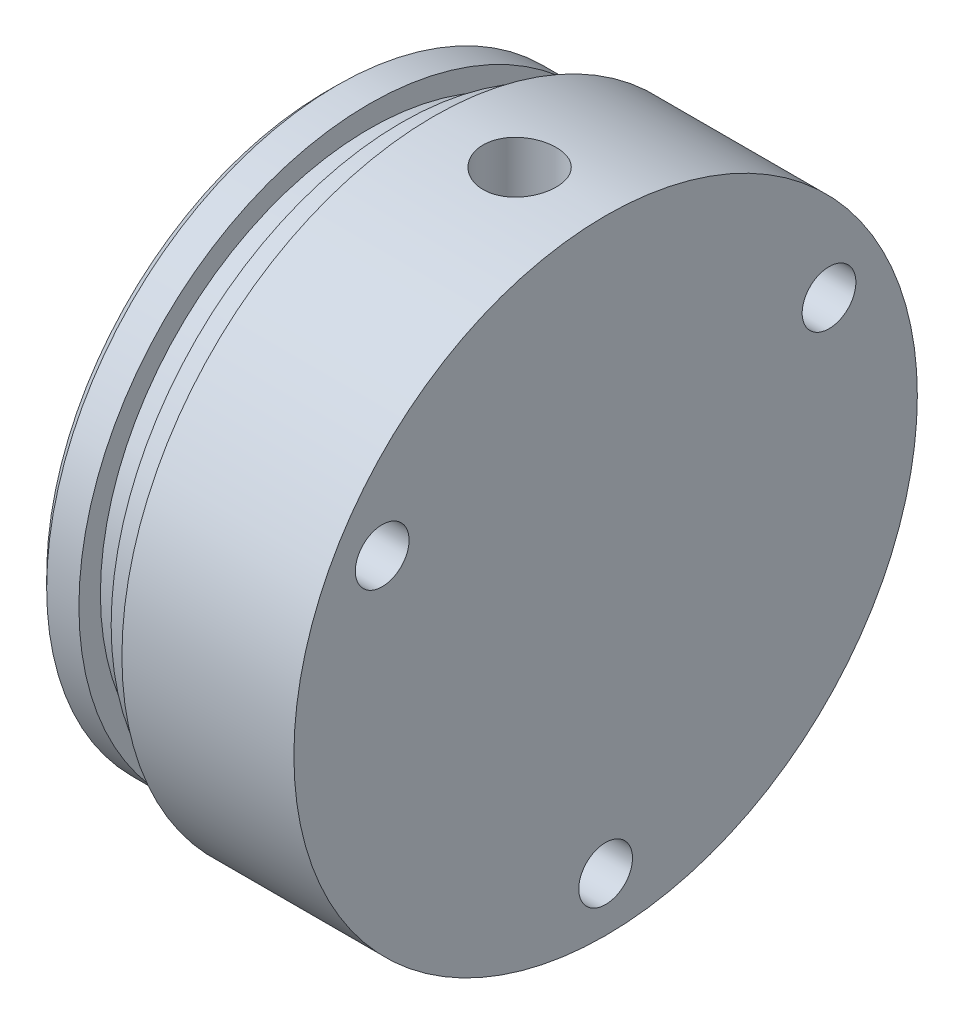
ISO-10303-21;
HEADER;
FILE_DESCRIPTION(('STEP AP214'),'2;1');
FILE_NAME('part.step','',(''),(''),'','','');
FILE_SCHEMA(('AUTOMOTIVE_DESIGN { 1 0 10303 214 1 1 1 1 }'));
ENDSEC;
DATA;
#1=APPLICATION_CONTEXT('core data for automotive mechanical design processes');
#2=APPLICATION_PROTOCOL_DEFINITION('international standard','automotive_design',2000,#1);
#3=PRODUCT_CONTEXT('',#1,'mechanical');
#4=PRODUCT('Part','Part','',(#3));
#5=PRODUCT_RELATED_PRODUCT_CATEGORY('part','',(#4));
#6=PRODUCT_DEFINITION_FORMATION('','',#4);
#7=PRODUCT_DEFINITION_CONTEXT('part definition',#1,'design');
#8=PRODUCT_DEFINITION('design','',#6,#7);
#9=PRODUCT_DEFINITION_SHAPE('','',#8);
#10=(LENGTH_UNIT() NAMED_UNIT(*) SI_UNIT(.MILLI.,.METRE.));
#11=(NAMED_UNIT(*) PLANE_ANGLE_UNIT() SI_UNIT($,.RADIAN.));
#12=(NAMED_UNIT(*) SI_UNIT($,.STERADIAN.) SOLID_ANGLE_UNIT());
#13=UNCERTAINTY_MEASURE_WITH_UNIT(LENGTH_MEASURE(1.E-05),#10,'distance_accuracy_value','');
#14=(GEOMETRIC_REPRESENTATION_CONTEXT(3) GLOBAL_UNCERTAINTY_ASSIGNED_CONTEXT((#13)) GLOBAL_UNIT_ASSIGNED_CONTEXT((#10,
#11,#12)) REPRESENTATION_CONTEXT('',''));
#15=CARTESIAN_POINT('',(0.,0.,0.));
#16=DIRECTION('',(0.,0.,1.));
#17=DIRECTION('',(1.,0.,0.));
#18=AXIS2_PLACEMENT_3D('',#15,#16,#17);
#19=CARTESIAN_POINT('',(0.,0.,0.));
#20=DIRECTION('',(1.,0.,0.));
#21=DIRECTION('',(0.,0.,-1.));
#22=AXIS2_PLACEMENT_3D('',#19,#20,#21);
#23=PLANE('',#22);
#24=CARTESIAN_POINT('',(0.,12.,0.));
#25=DIRECTION('',(-1.,0.,0.));
#26=DIRECTION('',(0.,0.,1.));
#27=AXIS2_PLACEMENT_3D('',#24,#25,#26);
#28=CIRCLE('',#27,2.74999999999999);
#29=CARTESIAN_POINT('',(0.,12.,2.74999999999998));
#30=VERTEX_POINT('',#29);
#31=EDGE_CURVE('E77',#30,#30,#28,.T.);
#32=ORIENTED_EDGE('',*,*,#31,.F.);
#33=EDGE_LOOP('',(#32));
#34=FACE_BOUND('',#33,.T.);
#35=CARTESIAN_POINT('',(0.,0.,0.));
#36=DIRECTION('',(1.,0.,0.));
#37=DIRECTION('',(0.,0.,-1.));
#38=AXIS2_PLACEMENT_3D('',#35,#36,#37);
#39=CIRCLE('',#38,26.);
#40=CARTESIAN_POINT('',(0.,0.,-26.));
#41=VERTEX_POINT('',#40);
#42=EDGE_CURVE('E125',#41,#41,#39,.F.);
#43=ORIENTED_EDGE('',*,*,#42,.T.);
#44=EDGE_LOOP('',(#43));
#45=FACE_BOUND('',#44,.T.);
#46=ADVANCED_FACE('F38',(#34,#45),#23,.F.);
#47=CARTESIAN_POINT('',(-46.0679162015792,0.,0.));
#48=DIRECTION('',(-1.,0.,0.));
#49=DIRECTION('',(0.,0.,1.));
#50=AXIS2_PLACEMENT_3D('',#47,#48,#49);
#51=CYLINDRICAL_SURFACE('',#50,27.);
#52=CARTESIAN_POINT('',(1.,0.,0.));
#53=DIRECTION('',(1.,0.,0.));
#54=DIRECTION('',(0.,0.,-1.));
#55=AXIS2_PLACEMENT_3D('',#52,#53,#54);
#56=CIRCLE('',#55,27.);
#57=CARTESIAN_POINT('',(1.,0.,27.));
#58=VERTEX_POINT('',#57);
#59=EDGE_CURVE('E51',#58,#58,#56,.T.);
#60=CARTESIAN_POINT('',(4.,0.,0.));
#61=DIRECTION('',(-1.,0.,0.));
#62=DIRECTION('',(0.,0.,1.));
#63=AXIS2_PLACEMENT_3D('',#60,#61,#62);
#64=CIRCLE('',#63,27.);
#65=CARTESIAN_POINT('',(4.,0.,27.));
#66=VERTEX_POINT('',#65);
#67=EDGE_CURVE('E122',#66,#66,#64,.T.);
#68=CARTESIAN_POINT('',(1.,0.,27.));
#69=CARTESIAN_POINT('',(1.03125,0.,27.));
#70=CARTESIAN_POINT('',(1.0625,0.,27.));
#71=CARTESIAN_POINT('',(1.125,0.,27.));
#72=CARTESIAN_POINT('',(1.15625,0.,27.));
#73=CARTESIAN_POINT('',(1.21875,0.,27.));
#74=CARTESIAN_POINT('',(1.25,0.,27.));
#75=CARTESIAN_POINT('',(1.3125,0.,27.));
#76=CARTESIAN_POINT('',(1.34375,0.,27.));
#77=CARTESIAN_POINT('',(1.40625,0.,27.));
#78=CARTESIAN_POINT('',(1.4375,0.,27.));
#79=CARTESIAN_POINT('',(1.5,0.,27.));
#80=CARTESIAN_POINT('',(1.53125,0.,27.));
#81=CARTESIAN_POINT('',(1.59375,0.,27.));
#82=CARTESIAN_POINT('',(1.625,0.,27.));
#83=CARTESIAN_POINT('',(1.6875,0.,27.));
#84=CARTESIAN_POINT('',(1.71875,0.,27.));
#85=CARTESIAN_POINT('',(1.78125,0.,27.));
#86=CARTESIAN_POINT('',(1.8125,0.,27.));
#87=CARTESIAN_POINT('',(1.875,0.,27.));
#88=CARTESIAN_POINT('',(1.90625,0.,27.));
#89=CARTESIAN_POINT('',(1.96875,0.,27.));
#90=CARTESIAN_POINT('',(2.,0.,27.));
#91=CARTESIAN_POINT('',(2.0625,0.,27.));
#92=CARTESIAN_POINT('',(2.09375,0.,27.));
#93=CARTESIAN_POINT('',(2.15625,0.,27.));
#94=CARTESIAN_POINT('',(2.1875,0.,27.));
#95=CARTESIAN_POINT('',(2.25,0.,27.));
#96=CARTESIAN_POINT('',(2.28125,0.,27.));
#97=CARTESIAN_POINT('',(2.34375,0.,27.));
#98=CARTESIAN_POINT('',(2.375,0.,27.));
#99=CARTESIAN_POINT('',(2.4375,0.,27.));
#100=CARTESIAN_POINT('',(2.46875,0.,27.));
#101=CARTESIAN_POINT('',(2.53125,0.,27.));
#102=CARTESIAN_POINT('',(2.5625,0.,27.));
#103=CARTESIAN_POINT('',(2.625,0.,27.));
#104=CARTESIAN_POINT('',(2.65625,0.,27.));
#105=CARTESIAN_POINT('',(2.71875,0.,27.));
#106=CARTESIAN_POINT('',(2.75,0.,27.));
#107=CARTESIAN_POINT('',(2.8125,0.,27.));
#108=CARTESIAN_POINT('',(2.84375,0.,27.));
#109=CARTESIAN_POINT('',(2.90625,0.,27.));
#110=CARTESIAN_POINT('',(2.9375,0.,27.));
#111=CARTESIAN_POINT('',(3.,0.,27.));
#112=CARTESIAN_POINT('',(3.03125,0.,27.));
#113=CARTESIAN_POINT('',(3.09375,0.,27.));
#114=CARTESIAN_POINT('',(3.125,0.,27.));
#115=CARTESIAN_POINT('',(3.1875,0.,27.));
#116=CARTESIAN_POINT('',(3.21875,0.,27.));
#117=CARTESIAN_POINT('',(3.28125,0.,27.));
#118=CARTESIAN_POINT('',(3.31250000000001,0.,27.));
#119=CARTESIAN_POINT('',(3.37500000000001,0.,27.));
#120=CARTESIAN_POINT('',(3.40625,0.,27.));
#121=CARTESIAN_POINT('',(3.46875,0.,27.));
#122=CARTESIAN_POINT('',(3.5,0.,27.));
#123=CARTESIAN_POINT('',(3.5625,0.,27.));
#124=CARTESIAN_POINT('',(3.59375,0.,27.));
#125=CARTESIAN_POINT('',(3.65625,0.,27.));
#126=CARTESIAN_POINT('',(3.68750000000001,0.,27.));
#127=CARTESIAN_POINT('',(3.75000000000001,0.,27.));
#128=CARTESIAN_POINT('',(3.78125,0.,27.));
#129=CARTESIAN_POINT('',(3.84375,0.,27.));
#130=CARTESIAN_POINT('',(3.875,0.,27.));
#131=CARTESIAN_POINT('',(3.9375,0.,27.));
#132=CARTESIAN_POINT('',(3.96875,0.,27.));
#133=CARTESIAN_POINT('',(4.,0.,27.));
#134=B_SPLINE_CURVE_WITH_KNOTS('',3,(#68,#69,#70,#71,#72,#73,#74,#75,#76,#77,#78,#79,#80,#81,
#82,#83,#84,#85,#86,#87,#88,#89,#90,#91,#92,#93,#94,#95,#96,#97,#98,#99,#100,#101,#102,#103,
#104,#105,#106,#107,#108,#109,#110,#111,#112,#113,#114,#115,#116,#117,#118,#119,#120,#121,#122,
#123,#124,#125,#126,#127,#128,#129,#130,#131,#132,#133),.UNSPECIFIED.,.F.,.F.,(4,2,2,2,2,2,2,2,
2,2,2,2,2,2,2,2,2,2,2,2,2,2,2,2,2,2,2,2,2,2,2,2,4),(0.,0.0937500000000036,0.1875,
0.281249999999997,0.375,0.468750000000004,0.5625,0.656249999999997,0.750000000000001,
0.843750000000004,0.937500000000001,1.03125,1.125,1.21875,1.3125,1.40625,1.5,1.59375,1.6875,
1.78125,1.875,1.96875000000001,2.0625,2.15625,2.25,2.34375000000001,2.4375,2.53125,2.625,
2.71875000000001,2.8125,2.90625,3.),.UNSPECIFIED.);
#135=EDGE_CURVE('BSEAM180',#58,#66,#134,.T.);
#136=ORIENTED_EDGE('',*,*,#59,.T.);
#137=ORIENTED_EDGE('',*,*,#67,.T.);
#138=ORIENTED_EDGE('',*,*,#135,.T.);
#139=ORIENTED_EDGE('',*,*,#135,.F.);
#140=EDGE_LOOP('',(#136,#138,#137,#139));
#141=FACE_BOUND('',#140,.T.);
#142=ADVANCED_FACE('F180',(#141),#51,.T.);
#143=CARTESIAN_POINT('',(4.,27.,0.));
#144=DIRECTION('',(-1.,0.,0.));
#145=DIRECTION('',(0.,0.,1.));
#146=AXIS2_PLACEMENT_3D('',#143,#144,#145);
#147=PLANE('',#146);
#148=ORIENTED_EDGE('',*,*,#67,.F.);
#149=EDGE_LOOP('',(#148));
#150=FACE_BOUND('',#149,.T.);
#151=CARTESIAN_POINT('',(4.,0.,0.));
#152=DIRECTION('',(-1.,0.,0.));
#153=DIRECTION('',(0.,0.,1.));
#154=AXIS2_PLACEMENT_3D('',#151,#152,#153);
#155=CIRCLE('',#154,25.);
#156=CARTESIAN_POINT('',(4.,0.,25.));
#157=VERTEX_POINT('',#156);
#158=EDGE_CURVE('E119',#157,#157,#155,.T.);
#159=ORIENTED_EDGE('',*,*,#158,.T.);
#160=EDGE_LOOP('',(#159));
#161=FACE_BOUND('',#160,.T.);
#162=ADVANCED_FACE('F185',(#150,#161),#147,.F.);
#163=CARTESIAN_POINT('',(-46.0679162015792,0.,0.));
#164=DIRECTION('',(-1.,0.,0.));
#165=DIRECTION('',(0.,0.,1.));
#166=AXIS2_PLACEMENT_3D('',#163,#164,#165);
#167=CYLINDRICAL_SURFACE('',#166,25.);
#168=CARTESIAN_POINT('',(7.00000000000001,0.,0.));
#169=DIRECTION('',(-1.,0.,0.));
#170=DIRECTION('',(0.,0.,1.));
#171=AXIS2_PLACEMENT_3D('',#168,#169,#170);
#172=CIRCLE('',#171,25.);
#173=CARTESIAN_POINT('',(7.00000000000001,0.,25.));
#174=VERTEX_POINT('',#173);
#175=EDGE_CURVE('E116',#174,#174,#172,.T.);
#176=CARTESIAN_POINT('',(4.,0.,25.));
#177=CARTESIAN_POINT('',(4.03125,0.,25.));
#178=CARTESIAN_POINT('',(4.06250000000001,0.,25.));
#179=CARTESIAN_POINT('',(4.12500000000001,0.,25.));
#180=CARTESIAN_POINT('',(4.15625,0.,25.));
#181=CARTESIAN_POINT('',(4.21875,0.,25.));
#182=CARTESIAN_POINT('',(4.25,0.,25.));
#183=CARTESIAN_POINT('',(4.3125,0.,25.));
#184=CARTESIAN_POINT('',(4.34375,0.,25.));
#185=CARTESIAN_POINT('',(4.40625,0.,25.));
#186=CARTESIAN_POINT('',(4.43750000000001,0.,25.));
#187=CARTESIAN_POINT('',(4.50000000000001,0.,25.));
#188=CARTESIAN_POINT('',(4.53125000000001,0.,25.));
#189=CARTESIAN_POINT('',(4.59375,0.,25.));
#190=CARTESIAN_POINT('',(4.625,0.,25.));
#191=CARTESIAN_POINT('',(4.6875,0.,25.));
#192=CARTESIAN_POINT('',(4.71875,0.,25.));
#193=CARTESIAN_POINT('',(4.78125000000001,0.,25.));
#194=CARTESIAN_POINT('',(4.81250000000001,0.,25.));
#195=CARTESIAN_POINT('',(4.87500000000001,0.,25.));
#196=CARTESIAN_POINT('',(4.90625000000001,0.,25.));
#197=CARTESIAN_POINT('',(4.96875,0.,25.));
#198=CARTESIAN_POINT('',(5.,0.,25.));
#199=CARTESIAN_POINT('',(5.0625,0.,25.));
#200=CARTESIAN_POINT('',(5.09375,0.,25.));
#201=CARTESIAN_POINT('',(5.15625000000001,0.,25.));
#202=CARTESIAN_POINT('',(5.18750000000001,0.,25.));
#203=CARTESIAN_POINT('',(5.25000000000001,0.,25.));
#204=CARTESIAN_POINT('',(5.28125000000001,0.,25.));
#205=CARTESIAN_POINT('',(5.34375,0.,25.));
#206=CARTESIAN_POINT('',(5.375,0.,25.));
#207=CARTESIAN_POINT('',(5.4375,0.,25.));
#208=CARTESIAN_POINT('',(5.46875,0.,25.));
#209=CARTESIAN_POINT('',(5.53125000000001,0.,25.));
#210=CARTESIAN_POINT('',(5.56250000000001,0.,25.));
#211=CARTESIAN_POINT('',(5.62500000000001,0.,25.));
#212=CARTESIAN_POINT('',(5.65625000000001,0.,25.));
#213=CARTESIAN_POINT('',(5.71875,0.,25.));
#214=CARTESIAN_POINT('',(5.75,0.,25.));
#215=CARTESIAN_POINT('',(5.8125,0.,25.));
#216=CARTESIAN_POINT('',(5.84375,0.,25.));
#217=CARTESIAN_POINT('',(5.90625000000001,0.,25.));
#218=CARTESIAN_POINT('',(5.93750000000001,0.,25.));
#219=CARTESIAN_POINT('',(6.00000000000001,0.,25.));
#220=CARTESIAN_POINT('',(6.03125000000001,0.,25.));
#221=CARTESIAN_POINT('',(6.09375,0.,25.));
#222=CARTESIAN_POINT('',(6.125,0.,25.));
#223=CARTESIAN_POINT('',(6.1875,0.,25.));
#224=CARTESIAN_POINT('',(6.21875,0.,25.));
#225=CARTESIAN_POINT('',(6.28125000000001,0.,25.));
#226=CARTESIAN_POINT('',(6.31250000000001,0.,25.));
#227=CARTESIAN_POINT('',(6.37500000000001,0.,25.));
#228=CARTESIAN_POINT('',(6.40625000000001,0.,25.));
#229=CARTESIAN_POINT('',(6.46875,0.,25.));
#230=CARTESIAN_POINT('',(6.5,0.,25.));
#231=CARTESIAN_POINT('',(6.5625,0.,25.));
#232=CARTESIAN_POINT('',(6.59375000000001,0.,25.));
#233=CARTESIAN_POINT('',(6.65625000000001,0.,25.));
#234=CARTESIAN_POINT('',(6.68750000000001,0.,25.));
#235=CARTESIAN_POINT('',(6.75000000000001,0.,25.));
#236=CARTESIAN_POINT('',(6.78125000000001,0.,25.));
#237=CARTESIAN_POINT('',(6.84375000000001,0.,25.));
#238=CARTESIAN_POINT('',(6.875,0.,25.));
#239=CARTESIAN_POINT('',(6.9375,0.,25.));
#240=CARTESIAN_POINT('',(6.96875000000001,0.,25.));
#241=CARTESIAN_POINT('',(7.00000000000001,0.,25.));
#242=B_SPLINE_CURVE_WITH_KNOTS('',3,(#176,#177,#178,#179,#180,#181,#182,#183,#184,#185,#186,
#187,#188,#189,#190,#191,#192,#193,#194,#195,#196,#197,#198,#199,#200,#201,#202,#203,#204,#205,
#206,#207,#208,#209,#210,#211,#212,#213,#214,#215,#216,#217,#218,#219,#220,#221,#222,#223,#224,
#225,#226,#227,#228,#229,#230,#231,#232,#233,#234,#235,#236,#237,#238,#239,#240,#241),
.UNSPECIFIED.,.F.,.F.,(4,2,2,2,2,2,2,2,2,2,2,2,2,2,2,2,2,2,2,2,2,2,2,2,2,2,2,2,2,2,2,2,4),(0.,
0.0937500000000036,0.1875,0.281249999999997,0.375,0.468750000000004,0.5625,0.656249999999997,
0.750000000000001,0.843750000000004,0.937500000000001,1.03125,1.125,1.21875,1.3125,1.40625,1.5,
1.59375,1.6875,1.78125,1.875,1.96875000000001,2.0625,2.15625,2.25,2.34375000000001,2.4375,
2.53125,2.625,2.71875000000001,2.8125,2.90625,3.),.UNSPECIFIED.);
#243=EDGE_CURVE('BSEAM193',#157,#174,#242,.T.);
#244=ORIENTED_EDGE('',*,*,#158,.F.);
#245=ORIENTED_EDGE('',*,*,#175,.T.);
#246=ORIENTED_EDGE('',*,*,#243,.T.);
#247=ORIENTED_EDGE('',*,*,#243,.F.);
#248=EDGE_LOOP('',(#244,#246,#245,#247));
#249=FACE_BOUND('',#248,.T.);
#250=ADVANCED_FACE('F193',(#249),#167,.T.);
#251=CARTESIAN_POINT('',(7.00000000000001,25.,0.));
#252=DIRECTION('',(1.,0.,0.));
#253=DIRECTION('',(0.,0.,-1.));
#254=AXIS2_PLACEMENT_3D('',#251,#252,#253);
#255=PLANE('',#254);
#256=ORIENTED_EDGE('',*,*,#175,.F.);
#257=EDGE_LOOP('',(#256));
#258=FACE_BOUND('',#257,.T.);
#259=CARTESIAN_POINT('',(7.00000000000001,0.,0.));
#260=DIRECTION('',(-1.,0.,0.));
#261=DIRECTION('',(0.,0.,1.));
#262=AXIS2_PLACEMENT_3D('',#259,#260,#261);
#263=CIRCLE('',#262,27.);
#264=CARTESIAN_POINT('',(7.00000000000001,0.,27.));
#265=VERTEX_POINT('',#264);
#266=EDGE_CURVE('E113',#265,#265,#263,.T.);
#267=ORIENTED_EDGE('',*,*,#266,.T.);
#268=EDGE_LOOP('',(#267));
#269=FACE_BOUND('',#268,.T.);
#270=ADVANCED_FACE('F197',(#258,#269),#255,.F.);
#271=CARTESIAN_POINT('',(-46.0679162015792,0.,0.));
#272=DIRECTION('',(-1.,0.,0.));
#273=DIRECTION('',(0.,0.,1.));
#274=AXIS2_PLACEMENT_3D('',#271,#272,#273);
#275=CYLINDRICAL_SURFACE('',#274,27.);
#276=CARTESIAN_POINT('',(10.,0.,0.));
#277=DIRECTION('',(-1.,0.,0.));
#278=DIRECTION('',(0.,0.,1.));
#279=AXIS2_PLACEMENT_3D('',#276,#277,#278);
#280=CIRCLE('',#279,27.);
#281=CARTESIAN_POINT('',(10.,0.,27.));
#282=VERTEX_POINT('',#281);
#283=EDGE_CURVE('E110',#282,#282,#280,.T.);
#284=CARTESIAN_POINT('',(7.00000000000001,0.,27.));
#285=CARTESIAN_POINT('',(7.03125000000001,0.,27.));
#286=CARTESIAN_POINT('',(7.06250000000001,0.,27.));
#287=CARTESIAN_POINT('',(7.12500000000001,0.,27.));
#288=CARTESIAN_POINT('',(7.15625000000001,0.,27.));
#289=CARTESIAN_POINT('',(7.21875000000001,0.,27.));
#290=CARTESIAN_POINT('',(7.25,0.,27.));
#291=CARTESIAN_POINT('',(7.3125,0.,27.));
#292=CARTESIAN_POINT('',(7.34375000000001,0.,27.));
#293=CARTESIAN_POINT('',(7.40625000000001,0.,27.));
#294=CARTESIAN_POINT('',(7.43750000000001,0.,27.));
#295=CARTESIAN_POINT('',(7.50000000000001,0.,27.));
#296=CARTESIAN_POINT('',(7.53125000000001,0.,27.));
#297=CARTESIAN_POINT('',(7.59375000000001,0.,27.));
#298=CARTESIAN_POINT('',(7.625,0.,27.));
#299=CARTESIAN_POINT('',(7.6875,0.,27.));
#300=CARTESIAN_POINT('',(7.71875000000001,0.,27.));
#301=CARTESIAN_POINT('',(7.78125000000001,0.,27.));
#302=CARTESIAN_POINT('',(7.81250000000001,0.,27.));
#303=CARTESIAN_POINT('',(7.87500000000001,0.,27.));
#304=CARTESIAN_POINT('',(7.90625000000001,0.,27.));
#305=CARTESIAN_POINT('',(7.96875000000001,0.,27.));
#306=CARTESIAN_POINT('',(8.00000000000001,0.,27.));
#307=CARTESIAN_POINT('',(8.06250000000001,0.,27.));
#308=CARTESIAN_POINT('',(8.09375000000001,0.,27.));
#309=CARTESIAN_POINT('',(8.15625000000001,0.,27.));
#310=CARTESIAN_POINT('',(8.18750000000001,0.,27.));
#311=CARTESIAN_POINT('',(8.25000000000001,0.,27.));
#312=CARTESIAN_POINT('',(8.28125000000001,0.,27.));
#313=CARTESIAN_POINT('',(8.34375000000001,0.,27.));
#314=CARTESIAN_POINT('',(8.37500000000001,0.,27.));
#315=CARTESIAN_POINT('',(8.43750000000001,0.,27.));
#316=CARTESIAN_POINT('',(8.46875000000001,0.,27.));
#317=CARTESIAN_POINT('',(8.53125000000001,0.,27.));
#318=CARTESIAN_POINT('',(8.56250000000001,0.,27.));
#319=CARTESIAN_POINT('',(8.62500000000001,0.,27.));
#320=CARTESIAN_POINT('',(8.65625000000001,0.,27.));
#321=CARTESIAN_POINT('',(8.71875000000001,0.,27.));
#322=CARTESIAN_POINT('',(8.75000000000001,0.,27.));
#323=CARTESIAN_POINT('',(8.81250000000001,0.,27.));
#324=CARTESIAN_POINT('',(8.84375000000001,0.,27.));
#325=CARTESIAN_POINT('',(8.90625000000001,0.,27.));
#326=CARTESIAN_POINT('',(8.93750000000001,0.,27.));
#327=CARTESIAN_POINT('',(9.00000000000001,0.,27.));
#328=CARTESIAN_POINT('',(9.03125000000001,0.,27.));
#329=CARTESIAN_POINT('',(9.09375000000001,0.,27.));
#330=CARTESIAN_POINT('',(9.12500000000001,0.,27.));
#331=CARTESIAN_POINT('',(9.18750000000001,0.,27.));
#332=CARTESIAN_POINT('',(9.21875000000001,0.,27.));
#333=CARTESIAN_POINT('',(9.28125000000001,0.,27.));
#334=CARTESIAN_POINT('',(9.31250000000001,0.,27.));
#335=CARTESIAN_POINT('',(9.37500000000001,0.,27.));
#336=CARTESIAN_POINT('',(9.40625000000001,0.,27.));
#337=CARTESIAN_POINT('',(9.46875000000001,0.,27.));
#338=CARTESIAN_POINT('',(9.50000000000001,0.,27.));
#339=CARTESIAN_POINT('',(9.56250000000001,0.,27.));
#340=CARTESIAN_POINT('',(9.59375000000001,0.,27.));
#341=CARTESIAN_POINT('',(9.65625000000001,0.,27.));
#342=CARTESIAN_POINT('',(9.68750000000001,0.,27.));
#343=CARTESIAN_POINT('',(9.75000000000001,0.,27.));
#344=CARTESIAN_POINT('',(9.78125000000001,0.,27.));
#345=CARTESIAN_POINT('',(9.84375000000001,0.,27.));
#346=CARTESIAN_POINT('',(9.87500000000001,0.,27.));
#347=CARTESIAN_POINT('',(9.93750000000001,0.,27.));
#348=CARTESIAN_POINT('',(9.96875000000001,0.,27.));
#349=CARTESIAN_POINT('',(10.,0.,27.));
#350=B_SPLINE_CURVE_WITH_KNOTS('',3,(#284,#285,#286,#287,#288,#289,#290,#291,#292,#293,#294,
#295,#296,#297,#298,#299,#300,#301,#302,#303,#304,#305,#306,#307,#308,#309,#310,#311,#312,#313,
#314,#315,#316,#317,#318,#319,#320,#321,#322,#323,#324,#325,#326,#327,#328,#329,#330,#331,#332,
#333,#334,#335,#336,#337,#338,#339,#340,#341,#342,#343,#344,#345,#346,#347,#348,#349),
.UNSPECIFIED.,.F.,.F.,(4,2,2,2,2,2,2,2,2,2,2,2,2,2,2,2,2,2,2,2,2,2,2,2,2,2,2,2,2,2,2,2,4),(0.,
0.0937500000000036,0.1875,0.281249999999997,0.375,0.468750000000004,0.5625,0.656249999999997,
0.750000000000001,0.843750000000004,0.937500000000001,1.03125,1.125,1.21875,1.3125,1.40625,1.5,
1.59375,1.6875,1.78125,1.875,1.96875000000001,2.0625,2.15625,2.25,2.34375000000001,2.4375,
2.53125,2.625,2.71875000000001,2.8125,2.90625,3.),.UNSPECIFIED.);
#351=EDGE_CURVE('BSEAM201',#265,#282,#350,.T.);
#352=ORIENTED_EDGE('',*,*,#266,.F.);
#353=ORIENTED_EDGE('',*,*,#283,.T.);
#354=ORIENTED_EDGE('',*,*,#351,.T.);
#355=ORIENTED_EDGE('',*,*,#351,.F.);
#356=EDGE_LOOP('',(#352,#354,#353,#355));
#357=FACE_BOUND('',#356,.T.);
#358=ADVANCED_FACE('F201',(#357),#275,.T.);
#359=CARTESIAN_POINT('',(10.,27.,0.));
#360=DIRECTION('',(1.,0.,0.));
#361=DIRECTION('',(0.,0.,-1.));
#362=AXIS2_PLACEMENT_3D('',#359,#360,#361);
#363=PLANE('',#362);
#364=ORIENTED_EDGE('',*,*,#283,.F.);
#365=EDGE_LOOP('',(#364));
#366=FACE_BOUND('',#365,.T.);
#367=CARTESIAN_POINT('',(10.,0.,0.));
#368=DIRECTION('',(-1.,0.,0.));
#369=DIRECTION('',(0.,0.,1.));
#370=AXIS2_PLACEMENT_3D('',#367,#368,#369);
#371=CIRCLE('',#370,29.);
#372=CARTESIAN_POINT('',(10.,0.,29.));
#373=VERTEX_POINT('',#372);
#374=EDGE_CURVE('E107',#373,#373,#371,.T.);
#375=ORIENTED_EDGE('',*,*,#374,.T.);
#376=EDGE_LOOP('',(#375));
#377=FACE_BOUND('',#376,.T.);
#378=ADVANCED_FACE('F175',(#366,#377),#363,.F.);
#379=CARTESIAN_POINT('',(-46.0679162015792,0.,0.));
#380=DIRECTION('',(-1.,0.,0.));
#381=DIRECTION('',(0.,0.,1.));
#382=AXIS2_PLACEMENT_3D('',#379,#380,#381);
#383=CYLINDRICAL_SURFACE('',#382,29.);
#384=CARTESIAN_POINT('',(18.,28.8,3.39999999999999));
#385=CARTESIAN_POINT('',(17.8097259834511,28.8000025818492,3.39999185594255));
#386=CARTESIAN_POINT('',(17.6193307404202,28.8019059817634,3.3839736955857));
#387=CARTESIAN_POINT('',(17.2438323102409,28.8093116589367,3.32032357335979));
#388=CARTESIAN_POINT('',(17.058734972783,28.8148177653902,3.27265797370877));
#389=CARTESIAN_POINT('',(16.6993237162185,28.8287968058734,3.14713167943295));
#390=CARTESIAN_POINT('',(16.5250028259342,28.8372677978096,3.06929074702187));
#391=CARTESIAN_POINT('',(16.191933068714,28.8562197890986,2.88566433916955));
#392=CARTESIAN_POINT('',(16.0331814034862,28.8667004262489,2.77988389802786));
#393=CARTESIAN_POINT('',(15.7349378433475,28.8885488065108,2.54282086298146));
#394=CARTESIAN_POINT('',(15.5955339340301,28.8999202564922,2.41142790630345));
#395=CARTESIAN_POINT('',(15.3407023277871,28.9222355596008,2.12710674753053));
#396=CARTESIAN_POINT('',(15.2252757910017,28.933179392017,1.97417750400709));
#397=CARTESIAN_POINT('',(15.0213631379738,28.953443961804,1.65057582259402));
#398=CARTESIAN_POINT('',(14.9329561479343,28.9627598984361,1.47985319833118));
#399=CARTESIAN_POINT('',(14.7860987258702,28.9786783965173,1.12585751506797));
#400=CARTESIAN_POINT('',(14.7276473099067,28.9852810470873,0.942584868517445));
#401=CARTESIAN_POINT('',(14.6426217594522,28.9950029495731,0.56958859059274));
#402=CARTESIAN_POINT('',(14.6159018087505,28.9981381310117,0.379898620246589));
#403=CARTESIAN_POINT('',(14.5946460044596,29.0006261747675,-0.00129724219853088));
#404=CARTESIAN_POINT('',(14.6001090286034,28.999979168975,-0.192803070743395));
#405=CARTESIAN_POINT('',(14.6429467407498,28.9949886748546,-0.571203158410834));
#406=CARTESIAN_POINT('',(14.6801646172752,28.9906633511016,-0.758115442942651));
#407=CARTESIAN_POINT('',(14.7852107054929,28.9788227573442,-1.12302259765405));
#408=CARTESIAN_POINT('',(14.853039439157,28.9713074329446,-1.30101731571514));
#409=CARTESIAN_POINT('',(15.0175503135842,28.9539001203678,-1.64352513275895));
#410=CARTESIAN_POINT('',(15.114300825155,28.9440025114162,-1.80800509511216));
#411=CARTESIAN_POINT('',(15.3338591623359,28.9229390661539,-2.11845291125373));
#412=CARTESIAN_POINT('',(15.4566680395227,28.9117731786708,-2.26442001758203));
#413=CARTESIAN_POINT('',(15.7257365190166,28.8893446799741,-2.53461899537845));
#414=CARTESIAN_POINT('',(15.8721327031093,28.8780818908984,-2.65871488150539));
#415=CARTESIAN_POINT('',(16.1837495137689,28.8567954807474,-2.88059328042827));
#416=CARTESIAN_POINT('',(16.3489701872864,28.8467718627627,-2.97837572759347));
#417=CARTESIAN_POINT('',(16.6936615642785,28.8290985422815,-3.14485651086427));
#418=CARTESIAN_POINT('',(16.8731371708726,28.8214496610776,-3.21354478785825));
#419=CARTESIAN_POINT('',(17.2411845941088,28.8094082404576,-3.31977118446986));
#420=CARTESIAN_POINT('',(17.4297560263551,28.8050155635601,-3.3573106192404));
#421=CARTESIAN_POINT('',(17.8094436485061,28.8000086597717,-3.39999536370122));
#422=CARTESIAN_POINT('',(18.0005380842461,28.799372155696,-3.40533166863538));
#423=CARTESIAN_POINT('',(18.3808982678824,28.8018907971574,-3.38396183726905));
#424=CARTESIAN_POINT('',(18.5701640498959,28.8050458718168,-3.35725629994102));
#425=CARTESIAN_POINT('',(18.9409272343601,28.8147718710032,-3.27272133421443));
#426=CARTESIAN_POINT('',(19.1224458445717,28.8213327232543,-3.21498366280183));
#427=CARTESIAN_POINT('',(19.4732240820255,28.8371228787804,-3.07011758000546));
#428=CARTESIAN_POINT('',(19.6424833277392,28.8463522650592,-2.98298825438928));
#429=CARTESIAN_POINT('',(19.9648044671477,28.8664931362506,-2.78133959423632));
#430=CARTESIAN_POINT('',(20.1177872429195,28.8774122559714,-2.66669457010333));
#431=CARTESIAN_POINT('',(20.4024072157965,28.8996779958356,-2.4134473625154));
#432=CARTESIAN_POINT('',(20.5340436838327,28.9110246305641,-2.27484436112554));
#433=CARTESIAN_POINT('',(20.7729012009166,28.9329349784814,-1.97678319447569));
#434=CARTESIAN_POINT('',(20.8799970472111,28.943494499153,-1.81722434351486));
#435=CARTESIAN_POINT('',(21.0658685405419,28.9625787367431,-1.4822729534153));
#436=CARTESIAN_POINT('',(21.144644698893,28.9711034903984,-1.30688070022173));
#437=CARTESIAN_POINT('',(21.2714320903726,28.9851389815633,-0.945664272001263));
#438=CARTESIAN_POINT('',(21.3195167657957,28.9906569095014,-0.759866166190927));
#439=CARTESIAN_POINT('',(21.383795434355,28.9980867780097,-0.382764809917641));
#440=CARTESIAN_POINT('',(21.3999906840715,28.9999988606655,-0.191461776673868));
#441=CARTESIAN_POINT('',(21.4000092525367,29.0000011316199,0.18999415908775));
#442=CARTESIAN_POINT('',(21.384026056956,28.9981141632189,0.380147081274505));
#443=CARTESIAN_POINT('',(21.3205498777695,28.9907756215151,0.755045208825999));
#444=CARTESIAN_POINT('',(21.2730568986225,28.9853240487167,0.939790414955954));
#445=CARTESIAN_POINT('',(21.1479677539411,28.9714663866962,1.29861133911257));
#446=CARTESIAN_POINT('',(21.070379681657,28.9630610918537,1.47268991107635));
#447=CARTESIAN_POINT('',(20.8873228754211,28.9442287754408,1.80538578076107));
#448=CARTESIAN_POINT('',(20.7818539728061,28.9338017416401,1.96400298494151));
#449=CARTESIAN_POINT('',(20.5453097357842,28.9120163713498,2.2622634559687));
#450=CARTESIAN_POINT('',(20.4140902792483,28.9006530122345,2.40179206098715));
#451=CARTESIAN_POINT('',(20.13006590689,28.8783168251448,2.65692759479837));
#452=CARTESIAN_POINT('',(19.9772558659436,28.8673440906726,2.77252882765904));
#453=CARTESIAN_POINT('',(19.6537975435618,28.8469916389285,2.97685823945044));
#454=CARTESIAN_POINT('',(19.4830902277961,28.8376174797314,3.06549346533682));
#455=CARTESIAN_POINT('',(19.1292044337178,28.821588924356,3.21271621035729));
#456=CARTESIAN_POINT('',(18.9460399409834,28.8149315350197,3.2713368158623));
#457=CARTESIAN_POINT('',(18.6349137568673,28.8067277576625,3.34263573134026));
#458=CARTESIAN_POINT('',(18.5089240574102,28.8042171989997,3.36411691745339));
#459=CARTESIAN_POINT('',(18.2553077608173,28.8008524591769,3.39280173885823));
#460=CARTESIAN_POINT('',(18.1276811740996,28.79999826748,3.40000546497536));
#461=CARTESIAN_POINT('',(18.,28.8,3.39999999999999));
#462=B_SPLINE_CURVE_WITH_KNOTS('',3,(#384,#385,#386,#387,#388,#389,#390,#391,#392,#393,#394,
#395,#396,#397,#398,#399,#400,#401,#402,#403,#404,#405,#406,#407,#408,#409,#410,#411,#412,#413,
#414,#415,#416,#417,#418,#419,#420,#421,#422,#423,#424,#425,#426,#427,#428,#429,#430,#431,#432,
#433,#434,#435,#436,#437,#438,#439,#440,#441,#442,#443,#444,#445,#446,#447,#448,#449,#450,#451,
#452,#453,#454,#455,#456,#457,#458,#459,#460,#461),.UNSPECIFIED.,.T.,.F.,(4,2,2,2,2,2,2,2,2,2,2,
2,2,2,2,2,2,2,2,2,2,2,2,2,2,2,2,2,2,2,2,2,2,2,2,2,2,2,4),(0.,0.570355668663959,1.14131853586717,
1.71190810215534,2.28239492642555,2.85539656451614,3.42842592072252,4.0031176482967,
4.57779049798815,5.14981219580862,5.72181394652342,6.29100728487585,6.86021032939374,
7.43076975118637,8.0013522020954,8.57536589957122,9.14938102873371,9.72359445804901,
10.29778364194,10.8685639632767,11.4393336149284,12.0084248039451,12.5775336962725,
13.1492934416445,13.7210727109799,14.2957072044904,14.870331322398,15.4435752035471,
16.0167964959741,16.5865813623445,17.1563661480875,17.7259978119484,18.2956329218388,
18.8685521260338,19.441607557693,20.0166165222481,20.5909902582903,20.9737232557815,
21.3564538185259),.UNSPECIFIED.);
#463=CARTESIAN_POINT('',(18.,28.8,3.39999999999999));
#464=VERTEX_POINT('',#463);
#465=EDGE_CURVE('E12',#464,#464,#462,.T.);
#466=ORIENTED_EDGE('',*,*,#465,.T.);
#467=EDGE_LOOP('',(#466));
#468=FACE_BOUND('',#467,.T.);
#469=ORIENTED_EDGE('',*,*,#374,.F.);
#470=EDGE_LOOP('',(#469));
#471=FACE_BOUND('',#470,.T.);
#472=CARTESIAN_POINT('',(26.,0.,0.));
#473=DIRECTION('',(-1.,0.,0.));
#474=DIRECTION('',(0.,0.,1.));
#475=AXIS2_PLACEMENT_3D('',#472,#473,#474);
#476=CIRCLE('',#475,29.);
#477=CARTESIAN_POINT('',(26.,0.,29.));
#478=VERTEX_POINT('',#477);
#479=EDGE_CURVE('E104',#478,#478,#476,.T.);
#480=ORIENTED_EDGE('',*,*,#479,.T.);
#481=EDGE_LOOP('',(#480));
#482=FACE_BOUND('',#481,.T.);
#483=ADVANCED_FACE('F135',(#468,#471,#482),#383,.T.);
#484=CARTESIAN_POINT('',(26.,29.,0.));
#485=DIRECTION('',(-1.,0.,0.));
#486=DIRECTION('',(0.,0.,1.));
#487=AXIS2_PLACEMENT_3D('',#484,#485,#486);
#488=PLANE('',#487);
#489=CARTESIAN_POINT('',(26.,11.9999999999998,-20.7846096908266));
#490=DIRECTION('',(1.,0.,0.));
#491=DIRECTION('',(0.,0.,-1.));
#492=AXIS2_PLACEMENT_3D('',#489,#490,#491);
#493=CIRCLE('',#492,2.5);
#494=CARTESIAN_POINT('',(26.,11.9999999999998,-23.2846096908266));
#495=VERTEX_POINT('',#494);
#496=EDGE_CURVE('E89',#495,#495,#493,.T.);
#497=ORIENTED_EDGE('',*,*,#496,.F.);
#498=EDGE_LOOP('',(#497));
#499=FACE_BOUND('',#498,.T.);
#500=CARTESIAN_POINT('',(26.,12.0000000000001,20.7846096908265));
#501=DIRECTION('',(1.,0.,0.));
#502=DIRECTION('',(0.,0.,-1.));
#503=AXIS2_PLACEMENT_3D('',#500,#501,#502);
#504=CIRCLE('',#503,2.5);
#505=CARTESIAN_POINT('',(26.,12.0000000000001,18.2846096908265));
#506=VERTEX_POINT('',#505);
#507=EDGE_CURVE('E95',#506,#506,#504,.T.);
#508=ORIENTED_EDGE('',*,*,#507,.F.);
#509=EDGE_LOOP('',(#508));
#510=FACE_BOUND('',#509,.T.);
#511=CARTESIAN_POINT('',(26.,-24.,0.));
#512=DIRECTION('',(1.,0.,0.));
#513=DIRECTION('',(0.,0.,-1.));
#514=AXIS2_PLACEMENT_3D('',#511,#512,#513);
#515=CIRCLE('',#514,2.5);
#516=CARTESIAN_POINT('',(26.,-24.,-2.50000000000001));
#517=VERTEX_POINT('',#516);
#518=EDGE_CURVE('E101',#517,#517,#515,.T.);
#519=ORIENTED_EDGE('',*,*,#518,.F.);
#520=EDGE_LOOP('',(#519));
#521=FACE_BOUND('',#520,.T.);
#522=ORIENTED_EDGE('',*,*,#479,.F.);
#523=EDGE_LOOP('',(#522));
#524=FACE_BOUND('',#523,.T.);
#525=ADVANCED_FACE('F168',(#499,#510,#521,#524),#488,.F.);
#526=CARTESIAN_POINT('',(26.,-24.,0.));
#527=DIRECTION('',(1.,0.,0.));
#528=DIRECTION('',(0.,0.,-1.));
#529=AXIS2_PLACEMENT_3D('',#526,#527,#528);
#530=CYLINDRICAL_SURFACE('',#529,2.5);
#531=CARTESIAN_POINT('',(9.00000000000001,-24.,0.));
#532=DIRECTION('',(1.,0.,0.));
#533=DIRECTION('',(0.,0.,-1.));
#534=AXIS2_PLACEMENT_3D('',#531,#532,#533);
#535=CIRCLE('',#534,2.5);
#536=CARTESIAN_POINT('',(9.00000000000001,-24.,-2.50000000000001));
#537=VERTEX_POINT('',#536);
#538=EDGE_CURVE('E98',#537,#537,#535,.T.);
#539=CARTESIAN_POINT('',(9.00000000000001,-24.,-2.50000000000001));
#540=CARTESIAN_POINT('',(9.17708333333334,-24.,-2.50000000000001));
#541=CARTESIAN_POINT('',(9.35416666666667,-24.,-2.50000000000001));
#542=CARTESIAN_POINT('',(9.70833333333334,-24.,-2.50000000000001));
#543=CARTESIAN_POINT('',(9.88541666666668,-24.,-2.50000000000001));
#544=CARTESIAN_POINT('',(10.2395833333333,-24.,-2.50000000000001));
#545=CARTESIAN_POINT('',(10.4166666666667,-24.,-2.50000000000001));
#546=CARTESIAN_POINT('',(10.7708333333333,-24.,-2.50000000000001));
#547=CARTESIAN_POINT('',(10.9479166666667,-24.,-2.50000000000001));
#548=CARTESIAN_POINT('',(11.3020833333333,-24.,-2.50000000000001));
#549=CARTESIAN_POINT('',(11.4791666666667,-24.,-2.50000000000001));
#550=CARTESIAN_POINT('',(11.8333333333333,-24.,-2.50000000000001));
#551=CARTESIAN_POINT('',(12.0104166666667,-24.,-2.50000000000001));
#552=CARTESIAN_POINT('',(12.3645833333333,-24.,-2.50000000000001));
#553=CARTESIAN_POINT('',(12.5416666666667,-24.,-2.50000000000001));
#554=CARTESIAN_POINT('',(12.8958333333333,-24.,-2.50000000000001));
#555=CARTESIAN_POINT('',(13.0729166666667,-24.,-2.50000000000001));
#556=CARTESIAN_POINT('',(13.4270833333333,-24.,-2.50000000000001));
#557=CARTESIAN_POINT('',(13.6041666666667,-24.,-2.50000000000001));
#558=CARTESIAN_POINT('',(13.9583333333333,-24.,-2.50000000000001));
#559=CARTESIAN_POINT('',(14.1354166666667,-24.,-2.50000000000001));
#560=CARTESIAN_POINT('',(14.4895833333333,-24.,-2.50000000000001));
#561=CARTESIAN_POINT('',(14.6666666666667,-24.,-2.50000000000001));
#562=CARTESIAN_POINT('',(15.0208333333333,-24.,-2.50000000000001));
#563=CARTESIAN_POINT('',(15.1979166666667,-24.,-2.50000000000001));
#564=CARTESIAN_POINT('',(15.5520833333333,-24.,-2.50000000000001));
#565=CARTESIAN_POINT('',(15.7291666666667,-24.,-2.50000000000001));
#566=CARTESIAN_POINT('',(16.0833333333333,-24.,-2.50000000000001));
#567=CARTESIAN_POINT('',(16.2604166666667,-24.,-2.50000000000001));
#568=CARTESIAN_POINT('',(16.6145833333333,-24.,-2.50000000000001));
#569=CARTESIAN_POINT('',(16.7916666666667,-24.,-2.50000000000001));
#570=CARTESIAN_POINT('',(17.1458333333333,-24.,-2.50000000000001));
#571=CARTESIAN_POINT('',(17.3229166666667,-24.,-2.50000000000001));
#572=CARTESIAN_POINT('',(17.6770833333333,-24.,-2.50000000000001));
#573=CARTESIAN_POINT('',(17.8541666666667,-24.,-2.50000000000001));
#574=CARTESIAN_POINT('',(18.2083333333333,-24.,-2.50000000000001));
#575=CARTESIAN_POINT('',(18.3854166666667,-24.,-2.50000000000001));
#576=CARTESIAN_POINT('',(18.7395833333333,-24.,-2.50000000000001));
#577=CARTESIAN_POINT('',(18.9166666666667,-24.,-2.50000000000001));
#578=CARTESIAN_POINT('',(19.2708333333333,-24.,-2.50000000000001));
#579=CARTESIAN_POINT('',(19.4479166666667,-24.,-2.50000000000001));
#580=CARTESIAN_POINT('',(19.8020833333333,-24.,-2.50000000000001));
#581=CARTESIAN_POINT('',(19.9791666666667,-24.,-2.50000000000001));
#582=CARTESIAN_POINT('',(20.3333333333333,-24.,-2.50000000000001));
#583=CARTESIAN_POINT('',(20.5104166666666,-24.,-2.50000000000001));
#584=CARTESIAN_POINT('',(20.8645833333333,-24.,-2.50000000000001));
#585=CARTESIAN_POINT('',(21.0416666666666,-24.,-2.50000000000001));
#586=CARTESIAN_POINT('',(21.3958333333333,-24.,-2.50000000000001));
#587=CARTESIAN_POINT('',(21.5729166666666,-24.,-2.50000000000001));
#588=CARTESIAN_POINT('',(21.9270833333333,-24.,-2.50000000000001));
#589=CARTESIAN_POINT('',(22.1041666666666,-24.,-2.50000000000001));
#590=CARTESIAN_POINT('',(22.4583333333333,-24.,-2.50000000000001));
#591=CARTESIAN_POINT('',(22.6354166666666,-24.,-2.50000000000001));
#592=CARTESIAN_POINT('',(22.9895833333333,-24.,-2.50000000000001));
#593=CARTESIAN_POINT('',(23.1666666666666,-24.,-2.50000000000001));
#594=CARTESIAN_POINT('',(23.5208333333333,-24.,-2.50000000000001));
#595=CARTESIAN_POINT('',(23.6979166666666,-24.,-2.50000000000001));
#596=CARTESIAN_POINT('',(24.0520833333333,-24.,-2.50000000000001));
#597=CARTESIAN_POINT('',(24.2291666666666,-24.,-2.50000000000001));
#598=CARTESIAN_POINT('',(24.5833333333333,-24.,-2.50000000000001));
#599=CARTESIAN_POINT('',(24.7604166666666,-24.,-2.50000000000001));
#600=CARTESIAN_POINT('',(25.1145833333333,-24.,-2.50000000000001));
#601=CARTESIAN_POINT('',(25.2916666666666,-24.,-2.50000000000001));
#602=CARTESIAN_POINT('',(25.6458333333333,-24.,-2.50000000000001));
#603=CARTESIAN_POINT('',(25.8229166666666,-24.,-2.50000000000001));
#604=CARTESIAN_POINT('',(26.,-24.,-2.50000000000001));
#605=B_SPLINE_CURVE_WITH_KNOTS('',3,(#539,#540,#541,#542,#543,#544,#545,#546,#547,#548,#549,
#550,#551,#552,#553,#554,#555,#556,#557,#558,#559,#560,#561,#562,#563,#564,#565,#566,#567,#568,
#569,#570,#571,#572,#573,#574,#575,#576,#577,#578,#579,#580,#581,#582,#583,#584,#585,#586,#587,
#588,#589,#590,#591,#592,#593,#594,#595,#596,#597,#598,#599,#600,#601,#602,#603,#604),
.UNSPECIFIED.,.F.,.F.,(4,2,2,2,2,2,2,2,2,2,2,2,2,2,2,2,2,2,2,2,2,2,2,2,2,2,2,2,2,2,2,2,4),(0.,
0.531249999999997,1.0625,1.59375,2.125,2.65624999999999,3.18749999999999,3.71874999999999,
4.24999999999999,4.78124999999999,5.31249999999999,5.84374999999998,6.37499999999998,
6.90624999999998,7.43749999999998,7.96874999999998,8.49999999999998,9.03124999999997,
9.56249999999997,10.09375,10.625,11.15625,11.6875,12.21875,12.75,13.28125,13.8125,14.34375,
14.875,15.40625,15.9375,16.46875,17.),.UNSPECIFIED.);
#606=EDGE_CURVE('BSEAM166',#537,#517,#605,.T.);
#607=ORIENTED_EDGE('',*,*,#538,.F.);
#608=ORIENTED_EDGE('',*,*,#518,.T.);
#609=ORIENTED_EDGE('',*,*,#606,.T.);
#610=ORIENTED_EDGE('',*,*,#606,.F.);
#611=EDGE_LOOP('',(#607,#609,#608,#610));
#612=FACE_BOUND('',#611,.T.);
#613=ADVANCED_FACE('F166',(#612),#530,.F.);
#614=CARTESIAN_POINT('',(9.00000000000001,-24.,0.));
#615=DIRECTION('',(1.,0.,0.));
#616=DIRECTION('',(0.,0.,-1.));
#617=AXIS2_PLACEMENT_3D('',#614,#615,#616);
#618=CONICAL_SURFACE('',#617,2.5,1.02974425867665);
#619=CARTESIAN_POINT('',(7.49784845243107,-24.,0.));
#620=VERTEX_POINT('',#619);
#621=VERTEX_LOOP('',#620);
#622=FACE_BOUND('',#621,.T.);
#623=ORIENTED_EDGE('',*,*,#538,.T.);
#624=EDGE_LOOP('',(#623));
#625=FACE_BOUND('',#624,.T.);
#626=ADVANCED_FACE('F162',(#622,#625),#618,.F.);
#627=CARTESIAN_POINT('',(26.,12.0000000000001,20.7846096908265));
#628=DIRECTION('',(1.,0.,0.));
#629=DIRECTION('',(0.,0.,-1.));
#630=AXIS2_PLACEMENT_3D('',#627,#628,#629);
#631=CYLINDRICAL_SURFACE('',#630,2.5);
#632=CARTESIAN_POINT('',(9.00000000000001,12.0000000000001,20.7846096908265));
#633=DIRECTION('',(1.,0.,0.));
#634=DIRECTION('',(0.,0.,-1.));
#635=AXIS2_PLACEMENT_3D('',#632,#633,#634);
#636=CIRCLE('',#635,2.5);
#637=CARTESIAN_POINT('',(9.00000000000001,12.0000000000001,18.2846096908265));
#638=VERTEX_POINT('',#637);
#639=EDGE_CURVE('E92',#638,#638,#636,.T.);
#640=CARTESIAN_POINT('',(9.00000000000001,12.0000000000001,18.2846096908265));
#641=CARTESIAN_POINT('',(9.17708333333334,12.0000000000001,18.2846096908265));
#642=CARTESIAN_POINT('',(9.35416666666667,12.0000000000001,18.2846096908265));
#643=CARTESIAN_POINT('',(9.70833333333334,12.0000000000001,18.2846096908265));
#644=CARTESIAN_POINT('',(9.88541666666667,12.0000000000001,18.2846096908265));
#645=CARTESIAN_POINT('',(10.2395833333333,12.0000000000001,18.2846096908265));
#646=CARTESIAN_POINT('',(10.4166666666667,12.0000000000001,18.2846096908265));
#647=CARTESIAN_POINT('',(10.7708333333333,12.0000000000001,18.2846096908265));
#648=CARTESIAN_POINT('',(10.9479166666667,12.0000000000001,18.2846096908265));
#649=CARTESIAN_POINT('',(11.3020833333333,12.0000000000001,18.2846096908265));
#650=CARTESIAN_POINT('',(11.4791666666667,12.0000000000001,18.2846096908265));
#651=CARTESIAN_POINT('',(11.8333333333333,12.0000000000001,18.2846096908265));
#652=CARTESIAN_POINT('',(12.0104166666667,12.0000000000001,18.2846096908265));
#653=CARTESIAN_POINT('',(12.3645833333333,12.0000000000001,18.2846096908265));
#654=CARTESIAN_POINT('',(12.5416666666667,12.0000000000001,18.2846096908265));
#655=CARTESIAN_POINT('',(12.8958333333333,12.0000000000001,18.2846096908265));
#656=CARTESIAN_POINT('',(13.0729166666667,12.0000000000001,18.2846096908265));
#657=CARTESIAN_POINT('',(13.4270833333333,12.0000000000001,18.2846096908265));
#658=CARTESIAN_POINT('',(13.6041666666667,12.0000000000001,18.2846096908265));
#659=CARTESIAN_POINT('',(13.9583333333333,12.0000000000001,18.2846096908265));
#660=CARTESIAN_POINT('',(14.1354166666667,12.0000000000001,18.2846096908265));
#661=CARTESIAN_POINT('',(14.4895833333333,12.0000000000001,18.2846096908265));
#662=CARTESIAN_POINT('',(14.6666666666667,12.0000000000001,18.2846096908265));
#663=CARTESIAN_POINT('',(15.0208333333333,12.0000000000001,18.2846096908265));
#664=CARTESIAN_POINT('',(15.1979166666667,12.0000000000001,18.2846096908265));
#665=CARTESIAN_POINT('',(15.5520833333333,12.0000000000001,18.2846096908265));
#666=CARTESIAN_POINT('',(15.7291666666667,12.0000000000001,18.2846096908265));
#667=CARTESIAN_POINT('',(16.0833333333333,12.0000000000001,18.2846096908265));
#668=CARTESIAN_POINT('',(16.2604166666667,12.0000000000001,18.2846096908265));
#669=CARTESIAN_POINT('',(16.6145833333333,12.0000000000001,18.2846096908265));
#670=CARTESIAN_POINT('',(16.7916666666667,12.0000000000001,18.2846096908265));
#671=CARTESIAN_POINT('',(17.1458333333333,12.0000000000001,18.2846096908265));
#672=CARTESIAN_POINT('',(17.3229166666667,12.0000000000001,18.2846096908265));
#673=CARTESIAN_POINT('',(17.6770833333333,12.0000000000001,18.2846096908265));
#674=CARTESIAN_POINT('',(17.8541666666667,12.0000000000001,18.2846096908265));
#675=CARTESIAN_POINT('',(18.2083333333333,12.0000000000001,18.2846096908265));
#676=CARTESIAN_POINT('',(18.3854166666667,12.0000000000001,18.2846096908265));
#677=CARTESIAN_POINT('',(18.7395833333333,12.0000000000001,18.2846096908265));
#678=CARTESIAN_POINT('',(18.9166666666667,12.0000000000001,18.2846096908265));
#679=CARTESIAN_POINT('',(19.2708333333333,12.0000000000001,18.2846096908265));
#680=CARTESIAN_POINT('',(19.4479166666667,12.0000000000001,18.2846096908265));
#681=CARTESIAN_POINT('',(19.8020833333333,12.0000000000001,18.2846096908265));
#682=CARTESIAN_POINT('',(19.9791666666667,12.0000000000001,18.2846096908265));
#683=CARTESIAN_POINT('',(20.3333333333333,12.0000000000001,18.2846096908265));
#684=CARTESIAN_POINT('',(20.5104166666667,12.0000000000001,18.2846096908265));
#685=CARTESIAN_POINT('',(20.8645833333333,12.0000000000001,18.2846096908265));
#686=CARTESIAN_POINT('',(21.0416666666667,12.0000000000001,18.2846096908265));
#687=CARTESIAN_POINT('',(21.3958333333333,12.0000000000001,18.2846096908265));
#688=CARTESIAN_POINT('',(21.5729166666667,12.0000000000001,18.2846096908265));
#689=CARTESIAN_POINT('',(21.9270833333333,12.0000000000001,18.2846096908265));
#690=CARTESIAN_POINT('',(22.1041666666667,12.0000000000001,18.2846096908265));
#691=CARTESIAN_POINT('',(22.4583333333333,12.0000000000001,18.2846096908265));
#692=CARTESIAN_POINT('',(22.6354166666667,12.0000000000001,18.2846096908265));
#693=CARTESIAN_POINT('',(22.9895833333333,12.0000000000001,18.2846096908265));
#694=CARTESIAN_POINT('',(23.1666666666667,12.0000000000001,18.2846096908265));
#695=CARTESIAN_POINT('',(23.5208333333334,12.0000000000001,18.2846096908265));
#696=CARTESIAN_POINT('',(23.6979166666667,12.0000000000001,18.2846096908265));
#697=CARTESIAN_POINT('',(24.0520833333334,12.0000000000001,18.2846096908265));
#698=CARTESIAN_POINT('',(24.2291666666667,12.0000000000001,18.2846096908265));
#699=CARTESIAN_POINT('',(24.5833333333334,12.0000000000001,18.2846096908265));
#700=CARTESIAN_POINT('',(24.7604166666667,12.0000000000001,18.2846096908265));
#701=CARTESIAN_POINT('',(25.1145833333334,12.0000000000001,18.2846096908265));
#702=CARTESIAN_POINT('',(25.2916666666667,12.0000000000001,18.2846096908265));
#703=CARTESIAN_POINT('',(25.6458333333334,12.0000000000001,18.2846096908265));
#704=CARTESIAN_POINT('',(25.8229166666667,12.0000000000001,18.2846096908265));
#705=CARTESIAN_POINT('',(26.,12.0000000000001,18.2846096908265));
#706=B_SPLINE_CURVE_WITH_KNOTS('',3,(#640,#641,#642,#643,#644,#645,#646,#647,#648,#649,#650,
#651,#652,#653,#654,#655,#656,#657,#658,#659,#660,#661,#662,#663,#664,#665,#666,#667,#668,#669,
#670,#671,#672,#673,#674,#675,#676,#677,#678,#679,#680,#681,#682,#683,#684,#685,#686,#687,#688,
#689,#690,#691,#692,#693,#694,#695,#696,#697,#698,#699,#700,#701,#702,#703,#704,#705),
.UNSPECIFIED.,.F.,.F.,(4,2,2,2,2,2,2,2,2,2,2,2,2,2,2,2,2,2,2,2,2,2,2,2,2,2,2,2,2,2,2,2,4),(0.,
0.53125,1.0625,1.59375,2.125,2.65625,3.1875,3.71875,4.25,4.78125,5.3125,5.84375,
6.37500000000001,6.90625000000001,7.43750000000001,7.96875000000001,8.50000000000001,
9.03125000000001,9.56250000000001,10.09375,10.625,11.15625,11.6875,12.21875,12.75,13.28125,
13.8125,14.34375,14.875,15.40625,15.9375,16.46875,17.),.UNSPECIFIED.);
#707=EDGE_CURVE('BSEAM159',#638,#506,#706,.T.);
#708=ORIENTED_EDGE('',*,*,#639,.F.);
#709=ORIENTED_EDGE('',*,*,#507,.T.);
#710=ORIENTED_EDGE('',*,*,#707,.T.);
#711=ORIENTED_EDGE('',*,*,#707,.F.);
#712=EDGE_LOOP('',(#708,#710,#709,#711));
#713=FACE_BOUND('',#712,.T.);
#714=ADVANCED_FACE('F159',(#713),#631,.F.);
#715=CARTESIAN_POINT('',(9.00000000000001,12.0000000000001,20.7846096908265));
#716=DIRECTION('',(1.,0.,0.));
#717=DIRECTION('',(0.,0.,-1.));
#718=AXIS2_PLACEMENT_3D('',#715,#716,#717);
#719=CONICAL_SURFACE('',#718,2.5,1.02974425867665);
#720=CARTESIAN_POINT('',(7.49784845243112,12.0000000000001,20.7846096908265));
#721=VERTEX_POINT('',#720);
#722=VERTEX_LOOP('',#721);
#723=FACE_BOUND('',#722,.T.);
#724=ORIENTED_EDGE('',*,*,#639,.T.);
#725=EDGE_LOOP('',(#724));
#726=FACE_BOUND('',#725,.T.);
#727=ADVANCED_FACE('F155',(#723,#726),#719,.F.);
#728=CARTESIAN_POINT('',(26.,11.9999999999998,-20.7846096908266));
#729=DIRECTION('',(1.,0.,0.));
#730=DIRECTION('',(0.,0.,-1.));
#731=AXIS2_PLACEMENT_3D('',#728,#729,#730);
#732=CYLINDRICAL_SURFACE('',#731,2.5);
#733=CARTESIAN_POINT('',(9.00000000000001,11.9999999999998,-20.7846096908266));
#734=DIRECTION('',(1.,0.,0.));
#735=DIRECTION('',(0.,0.,-1.));
#736=AXIS2_PLACEMENT_3D('',#733,#734,#735);
#737=CIRCLE('',#736,2.5);
#738=CARTESIAN_POINT('',(9.00000000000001,11.9999999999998,-23.2846096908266));
#739=VERTEX_POINT('',#738);
#740=EDGE_CURVE('E86',#739,#739,#737,.T.);
#741=CARTESIAN_POINT('',(9.00000000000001,11.9999999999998,-23.2846096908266));
#742=CARTESIAN_POINT('',(9.17708333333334,11.9999999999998,-23.2846096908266));
#743=CARTESIAN_POINT('',(9.35416666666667,11.9999999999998,-23.2846096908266));
#744=CARTESIAN_POINT('',(9.70833333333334,11.9999999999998,-23.2846096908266));
#745=CARTESIAN_POINT('',(9.88541666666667,11.9999999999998,-23.2846096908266));
#746=CARTESIAN_POINT('',(10.2395833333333,11.9999999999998,-23.2846096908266));
#747=CARTESIAN_POINT('',(10.4166666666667,11.9999999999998,-23.2846096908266));
#748=CARTESIAN_POINT('',(10.7708333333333,11.9999999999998,-23.2846096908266));
#749=CARTESIAN_POINT('',(10.9479166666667,11.9999999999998,-23.2846096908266));
#750=CARTESIAN_POINT('',(11.3020833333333,11.9999999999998,-23.2846096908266));
#751=CARTESIAN_POINT('',(11.4791666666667,11.9999999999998,-23.2846096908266));
#752=CARTESIAN_POINT('',(11.8333333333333,11.9999999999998,-23.2846096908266));
#753=CARTESIAN_POINT('',(12.0104166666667,11.9999999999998,-23.2846096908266));
#754=CARTESIAN_POINT('',(12.3645833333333,11.9999999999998,-23.2846096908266));
#755=CARTESIAN_POINT('',(12.5416666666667,11.9999999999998,-23.2846096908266));
#756=CARTESIAN_POINT('',(12.8958333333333,11.9999999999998,-23.2846096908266));
#757=CARTESIAN_POINT('',(13.0729166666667,11.9999999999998,-23.2846096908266));
#758=CARTESIAN_POINT('',(13.4270833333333,11.9999999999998,-23.2846096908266));
#759=CARTESIAN_POINT('',(13.6041666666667,11.9999999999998,-23.2846096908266));
#760=CARTESIAN_POINT('',(13.9583333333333,11.9999999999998,-23.2846096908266));
#761=CARTESIAN_POINT('',(14.1354166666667,11.9999999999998,-23.2846096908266));
#762=CARTESIAN_POINT('',(14.4895833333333,11.9999999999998,-23.2846096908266));
#763=CARTESIAN_POINT('',(14.6666666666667,11.9999999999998,-23.2846096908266));
#764=CARTESIAN_POINT('',(15.0208333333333,11.9999999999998,-23.2846096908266));
#765=CARTESIAN_POINT('',(15.1979166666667,11.9999999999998,-23.2846096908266));
#766=CARTESIAN_POINT('',(15.5520833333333,11.9999999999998,-23.2846096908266));
#767=CARTESIAN_POINT('',(15.7291666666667,11.9999999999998,-23.2846096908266));
#768=CARTESIAN_POINT('',(16.0833333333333,11.9999999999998,-23.2846096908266));
#769=CARTESIAN_POINT('',(16.2604166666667,11.9999999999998,-23.2846096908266));
#770=CARTESIAN_POINT('',(16.6145833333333,11.9999999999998,-23.2846096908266));
#771=CARTESIAN_POINT('',(16.7916666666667,11.9999999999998,-23.2846096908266));
#772=CARTESIAN_POINT('',(17.1458333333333,11.9999999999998,-23.2846096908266));
#773=CARTESIAN_POINT('',(17.3229166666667,11.9999999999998,-23.2846096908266));
#774=CARTESIAN_POINT('',(17.6770833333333,11.9999999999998,-23.2846096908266));
#775=CARTESIAN_POINT('',(17.8541666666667,11.9999999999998,-23.2846096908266));
#776=CARTESIAN_POINT('',(18.2083333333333,11.9999999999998,-23.2846096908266));
#777=CARTESIAN_POINT('',(18.3854166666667,11.9999999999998,-23.2846096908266));
#778=CARTESIAN_POINT('',(18.7395833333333,11.9999999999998,-23.2846096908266));
#779=CARTESIAN_POINT('',(18.9166666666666,11.9999999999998,-23.2846096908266));
#780=CARTESIAN_POINT('',(19.2708333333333,11.9999999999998,-23.2846096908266));
#781=CARTESIAN_POINT('',(19.4479166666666,11.9999999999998,-23.2846096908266));
#782=CARTESIAN_POINT('',(19.8020833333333,11.9999999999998,-23.2846096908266));
#783=CARTESIAN_POINT('',(19.9791666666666,11.9999999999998,-23.2846096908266));
#784=CARTESIAN_POINT('',(20.3333333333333,11.9999999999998,-23.2846096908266));
#785=CARTESIAN_POINT('',(20.5104166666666,11.9999999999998,-23.2846096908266));
#786=CARTESIAN_POINT('',(20.8645833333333,11.9999999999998,-23.2846096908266));
#787=CARTESIAN_POINT('',(21.0416666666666,11.9999999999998,-23.2846096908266));
#788=CARTESIAN_POINT('',(21.3958333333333,11.9999999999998,-23.2846096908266));
#789=CARTESIAN_POINT('',(21.5729166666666,11.9999999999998,-23.2846096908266));
#790=CARTESIAN_POINT('',(21.9270833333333,11.9999999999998,-23.2846096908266));
#791=CARTESIAN_POINT('',(22.1041666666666,11.9999999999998,-23.2846096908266));
#792=CARTESIAN_POINT('',(22.4583333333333,11.9999999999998,-23.2846096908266));
#793=CARTESIAN_POINT('',(22.6354166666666,11.9999999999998,-23.2846096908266));
#794=CARTESIAN_POINT('',(22.9895833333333,11.9999999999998,-23.2846096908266));
#795=CARTESIAN_POINT('',(23.1666666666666,11.9999999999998,-23.2846096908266));
#796=CARTESIAN_POINT('',(23.5208333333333,11.9999999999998,-23.2846096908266));
#797=CARTESIAN_POINT('',(23.6979166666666,11.9999999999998,-23.2846096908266));
#798=CARTESIAN_POINT('',(24.0520833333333,11.9999999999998,-23.2846096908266));
#799=CARTESIAN_POINT('',(24.2291666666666,11.9999999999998,-23.2846096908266));
#800=CARTESIAN_POINT('',(24.5833333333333,11.9999999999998,-23.2846096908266));
#801=CARTESIAN_POINT('',(24.7604166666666,11.9999999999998,-23.2846096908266));
#802=CARTESIAN_POINT('',(25.1145833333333,11.9999999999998,-23.2846096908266));
#803=CARTESIAN_POINT('',(25.2916666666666,11.9999999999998,-23.2846096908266));
#804=CARTESIAN_POINT('',(25.6458333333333,11.9999999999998,-23.2846096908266));
#805=CARTESIAN_POINT('',(25.8229166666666,11.9999999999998,-23.2846096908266));
#806=CARTESIAN_POINT('',(26.,11.9999999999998,-23.2846096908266));
#807=B_SPLINE_CURVE_WITH_KNOTS('',3,(#741,#742,#743,#744,#745,#746,#747,#748,#749,#750,#751,
#752,#753,#754,#755,#756,#757,#758,#759,#760,#761,#762,#763,#764,#765,#766,#767,#768,#769,#770,
#771,#772,#773,#774,#775,#776,#777,#778,#779,#780,#781,#782,#783,#784,#785,#786,#787,#788,#789,
#790,#791,#792,#793,#794,#795,#796,#797,#798,#799,#800,#801,#802,#803,#804,#805,#806),
.UNSPECIFIED.,.F.,.F.,(4,2,2,2,2,2,2,2,2,2,2,2,2,2,2,2,2,2,2,2,2,2,2,2,2,2,2,2,2,2,2,2,4),(0.,
0.53125,1.0625,1.59375,2.125,2.65624999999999,3.18749999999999,3.71874999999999,
4.24999999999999,4.78124999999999,5.31249999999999,5.84374999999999,6.37499999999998,
6.90624999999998,7.43749999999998,7.96874999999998,8.49999999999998,9.03124999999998,
9.56249999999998,10.09375,10.625,11.15625,11.6875,12.21875,12.75,13.28125,13.8125,14.34375,
14.875,15.40625,15.9375,16.46875,17.),.UNSPECIFIED.);
#808=EDGE_CURVE('BSEAM151',#739,#495,#807,.T.);
#809=ORIENTED_EDGE('',*,*,#740,.F.);
#810=ORIENTED_EDGE('',*,*,#496,.T.);
#811=ORIENTED_EDGE('',*,*,#808,.T.);
#812=ORIENTED_EDGE('',*,*,#808,.F.);
#813=EDGE_LOOP('',(#809,#811,#810,#812));
#814=FACE_BOUND('',#813,.T.);
#815=ADVANCED_FACE('F151',(#814),#732,.F.);
#816=CARTESIAN_POINT('',(9.00000000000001,11.9999999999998,-20.7846096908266));
#817=DIRECTION('',(1.,0.,0.));
#818=DIRECTION('',(0.,0.,-1.));
#819=AXIS2_PLACEMENT_3D('',#816,#817,#818);
#820=CONICAL_SURFACE('',#819,2.5,1.02974425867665);
#821=CARTESIAN_POINT('',(7.49784845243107,11.9999999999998,-20.7846096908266));
#822=VERTEX_POINT('',#821);
#823=VERTEX_LOOP('',#822);
#824=FACE_BOUND('',#823,.T.);
#825=ORIENTED_EDGE('',*,*,#740,.T.);
#826=EDGE_LOOP('',(#825));
#827=FACE_BOUND('',#826,.T.);
#828=ADVANCED_FACE('F146',(#824,#827),#820,.F.);
#829=CARTESIAN_POINT('',(0.,0.,0.));
#830=DIRECTION('',(1.,0.,0.));
#831=DIRECTION('',(0.,0.,-1.));
#832=AXIS2_PLACEMENT_3D('',#829,#830,#831);
#833=CONICAL_SURFACE('',#832,26.,0.785398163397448);
#834=ORIENTED_EDGE('',*,*,#59,.F.);
#835=EDGE_LOOP('',(#834));
#836=FACE_BOUND('',#835,.T.);
#837=ORIENTED_EDGE('',*,*,#42,.F.);
#838=EDGE_LOOP('',(#837));
#839=FACE_BOUND('',#838,.T.);
#840=ADVANCED_FACE('F40',(#836,#839),#833,.T.);
#841=CARTESIAN_POINT('',(18.,29.,0.));
#842=DIRECTION('',(0.,1.,0.));
#843=DIRECTION('',(0.,0.,1.));
#844=AXIS2_PLACEMENT_3D('',#841,#842,#843);
#845=CYLINDRICAL_SURFACE('',#844,3.39999999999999);
#846=CARTESIAN_POINT('',(19.9993749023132,12.,2.74999999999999));
#847=CARTESIAN_POINT('',(19.999392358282,11.8983026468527,2.74999275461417));
#848=CARTESIAN_POINT('',(20.0072969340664,11.7964386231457,2.74429235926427));
#849=CARTESIAN_POINT('',(20.0373507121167,11.5959634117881,2.72204326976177));
#850=CARTESIAN_POINT('',(20.0595456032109,11.4973637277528,2.7054597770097));
#851=CARTESIAN_POINT('',(20.1244380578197,11.271039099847,2.65498968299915));
#852=CARTESIAN_POINT('',(20.1716341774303,11.1455530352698,2.61703022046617));
#853=CARTESIAN_POINT('',(20.2769757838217,10.9050544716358,2.52591343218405));
#854=CARTESIAN_POINT('',(20.3351539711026,10.7900748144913,2.47271046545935));
#855=CARTESIAN_POINT('',(20.4375101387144,10.6043216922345,2.37108460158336));
#856=CARTESIAN_POINT('',(20.4804646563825,10.5308603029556,2.32625764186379));
#857=CARTESIAN_POINT('',(20.5671848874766,10.38875564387,2.23019208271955));
#858=CARTESIAN_POINT('',(20.6109509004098,10.3201141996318,2.17895107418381));
#859=CARTESIAN_POINT('',(20.741477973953,10.1216500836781,2.015839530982));
#860=CARTESIAN_POINT('',(20.8276414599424,9.99899125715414,1.89441769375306));
#861=CARTESIAN_POINT('',(20.9733277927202,9.79844689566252,1.65378088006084));
#862=CARTESIAN_POINT('',(21.0347218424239,9.71651887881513,1.53904227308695));
#863=CARTESIAN_POINT('',(21.1467915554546,9.56955411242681,1.2944877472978));
#864=CARTESIAN_POINT('',(21.1974839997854,9.50449088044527,1.16469593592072));
#865=CARTESIAN_POINT('',(21.2768532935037,9.40364514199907,0.914608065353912));
#866=CARTESIAN_POINT('',(21.307780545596,9.36480571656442,0.796265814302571));
#867=CARTESIAN_POINT('',(21.357030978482,9.30324223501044,0.552914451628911));
#868=CARTESIAN_POINT('',(21.3753611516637,9.28050923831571,0.427909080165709));
#869=CARTESIAN_POINT('',(21.3979293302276,9.25254792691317,0.174200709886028));
#870=CARTESIAN_POINT('',(21.4021159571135,9.2473834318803,0.0454859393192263));
#871=CARTESIAN_POINT('',(21.395868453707,9.2551087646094,-0.211039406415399));
#872=CARTESIAN_POINT('',(21.3854339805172,9.26799901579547,-0.33884996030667));
#873=CARTESIAN_POINT('',(21.3518877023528,9.30968557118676,-0.582315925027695));
#874=CARTESIAN_POINT('',(21.3295423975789,9.33752083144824,-0.698247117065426));
#875=CARTESIAN_POINT('',(21.2743051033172,9.40692954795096,-0.92323313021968));
#876=CARTESIAN_POINT('',(21.2414104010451,9.44850653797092,-1.03228617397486));
#877=CARTESIAN_POINT('',(21.1635608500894,9.5481280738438,-1.25166936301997));
#878=CARTESIAN_POINT('',(21.1177640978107,9.60735158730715,-1.36115953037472));
#879=CARTESIAN_POINT('',(21.018638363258,9.73803401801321,-1.56878327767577));
#880=CARTESIAN_POINT('',(20.9653055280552,9.80949919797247,-1.66691100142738));
#881=CARTESIAN_POINT('',(20.8422292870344,9.97889896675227,-1.87046541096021));
#882=CARTESIAN_POINT('',(20.771373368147,10.079250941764,-1.97320291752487));
#883=CARTESIAN_POINT('',(20.6272548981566,10.2937410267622,-2.16138446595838));
#884=CARTESIAN_POINT('',(20.5539892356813,10.4078975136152,-2.24680504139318));
#885=CARTESIAN_POINT('',(20.4158314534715,10.6409739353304,-2.39441666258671));
#886=CARTESIAN_POINT('',(20.3507131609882,10.7589905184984,-2.45782090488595));
#887=CARTESIAN_POINT('',(20.2297757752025,11.0069819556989,-2.56802442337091));
#888=CARTESIAN_POINT('',(20.1739365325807,11.1369299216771,-2.61485993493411));
#889=CARTESIAN_POINT('',(20.0961670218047,11.3645513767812,-2.67726220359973));
#890=CARTESIAN_POINT('',(20.0691138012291,11.4590005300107,-2.69804410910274));
#891=CARTESIAN_POINT('',(20.0272414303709,11.652108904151,-2.72965095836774));
#892=CARTESIAN_POINT('',(20.0123933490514,11.7507575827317,-2.74049945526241));
#893=CARTESIAN_POINT('',(19.9974992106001,11.950514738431,-2.75138200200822));
#894=CARTESIAN_POINT('',(19.9975550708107,12.0516354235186,-2.75134159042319));
#895=CARTESIAN_POINT('',(20.0127190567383,12.2521716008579,-2.74026121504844));
#896=CARTESIAN_POINT('',(20.0278468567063,12.3515846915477,-2.72920687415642));
#897=CARTESIAN_POINT('',(20.0752960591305,12.5683497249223,-2.69336131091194));
#898=CARTESIAN_POINT('',(20.1107781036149,12.6845512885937,-2.66598999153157));
#899=CARTESIAN_POINT('',(20.1936854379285,12.908686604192,-2.5981902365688));
#900=CARTESIAN_POINT('',(20.2411471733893,13.0165937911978,-2.55772184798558));
#901=CARTESIAN_POINT('',(20.3297059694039,13.1977329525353,-2.47691708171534));
#902=CARTESIAN_POINT('',(20.3693826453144,13.2728389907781,-2.43912919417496));
#903=CARTESIAN_POINT('',(20.4507255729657,13.4185255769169,-2.35738587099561));
#904=CARTESIAN_POINT('',(20.4923927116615,13.4891040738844,-2.31342766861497));
#905=CARTESIAN_POINT('',(20.5764008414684,13.6258065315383,-2.21948882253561));
#906=CARTESIAN_POINT('',(20.6187423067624,13.6919271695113,-2.16950376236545));
#907=CARTESIAN_POINT('',(20.7029711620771,13.8195731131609,-2.06362342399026));
#908=CARTESIAN_POINT('',(20.7448583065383,13.8810960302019,-2.00772510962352));
#909=CARTESIAN_POINT('',(20.8699431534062,14.0607296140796,-1.82887104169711));
#910=CARTESIAN_POINT('',(20.9509632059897,14.1714047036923,-1.69645860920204));
#911=CARTESIAN_POINT('',(21.0618323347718,14.3191240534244,-1.4804574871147));
#912=CARTESIAN_POINT('',(21.0969879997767,14.3652853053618,-1.40562686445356));
#913=CARTESIAN_POINT('',(21.1628500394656,14.450892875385,-1.25039040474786));
#914=CARTESIAN_POINT('',(21.1935588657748,14.4903428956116,-1.16998767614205));
#915=CARTESIAN_POINT('',(21.2596454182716,14.5746260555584,-0.974105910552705));
#916=CARTESIAN_POINT('',(21.2927159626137,14.6162736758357,-0.856430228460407));
#917=CARTESIAN_POINT('',(21.3464186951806,14.683547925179,-0.613906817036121));
#918=CARTESIAN_POINT('',(21.3670604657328,14.7091868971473,-0.489064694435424));
#919=CARTESIAN_POINT('',(21.3942881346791,14.7429535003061,-0.234927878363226));
#920=CARTESIAN_POINT('',(21.4008140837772,14.7510064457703,-0.105616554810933));
#921=CARTESIAN_POINT('',(21.3990225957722,14.7487916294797,0.152745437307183));
#922=CARTESIAN_POINT('',(21.3907054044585,14.7385241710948,0.281796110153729));
#923=CARTESIAN_POINT('',(21.3609901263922,14.7016406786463,0.527321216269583));
#924=CARTESIAN_POINT('',(21.3404653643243,14.6761156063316,0.644071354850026));
#925=CARTESIAN_POINT('',(21.288593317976,14.6110782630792,0.871046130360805));
#926=CARTESIAN_POINT('',(21.2572432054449,14.5715623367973,0.981269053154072));
#927=CARTESIAN_POINT('',(21.1827284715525,14.4765304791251,1.20204253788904));
#928=CARTESIAN_POINT('',(21.138807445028,14.4199705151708,1.31188303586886));
#929=CARTESIAN_POINT('',(21.0431974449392,14.2946009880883,1.52057447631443));
#930=CARTESIAN_POINT('',(20.9915052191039,14.2257862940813,1.61942078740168));
#931=CARTESIAN_POINT('',(20.8720012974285,14.0626657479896,1.82437909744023));
#932=CARTESIAN_POINT('',(20.8030391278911,13.9660168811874,1.92795020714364));
#933=CARTESIAN_POINT('',(20.6620456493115,13.7591880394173,2.11838744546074));
#934=CARTESIAN_POINT('',(20.5900098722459,13.6489878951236,2.20522816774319));
#935=CARTESIAN_POINT('',(20.4489281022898,13.4171001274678,2.36085397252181));
#936=CARTESIAN_POINT('',(20.3798571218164,13.2955605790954,2.42983680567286));
#937=CARTESIAN_POINT('',(20.2507177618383,13.0394391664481,2.54989977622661));
#938=CARTESIAN_POINT('',(20.190632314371,12.9048828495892,2.60101410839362));
#939=CARTESIAN_POINT('',(20.1067916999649,12.6698683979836,2.66895558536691));
#940=CARTESIAN_POINT('',(20.077606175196,12.5730475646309,2.69153257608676));
#941=CARTESIAN_POINT('',(20.0319392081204,12.3747731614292,2.72618248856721));
#942=CARTESIAN_POINT('',(20.0154083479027,12.2733392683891,2.73829629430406));
#943=CARTESIAN_POINT('',(20.0042514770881,12.1426139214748,2.74644849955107));
#944=CARTESIAN_POINT('',(20.0024283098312,12.1141443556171,2.74777798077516));
#945=CARTESIAN_POINT('',(19.9999874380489,12.0571209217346,2.74955484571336));
#946=CARTESIAN_POINT('',(19.9993699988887,12.0285670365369,2.75000203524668));
#947=CARTESIAN_POINT('',(19.9993749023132,12.,2.74999999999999));
#948=B_SPLINE_CURVE_WITH_KNOTS('',3,(#846,#847,#848,#849,#850,#851,#852,#853,#854,#855,#856,
#857,#858,#859,#860,#861,#862,#863,#864,#865,#866,#867,#868,#869,#870,#871,#872,#873,#874,#875,
#876,#877,#878,#879,#880,#881,#882,#883,#884,#885,#886,#887,#888,#889,#890,#891,#892,#893,#894,
#895,#896,#897,#898,#899,#900,#901,#902,#903,#904,#905,#906,#907,#908,#909,#910,#911,#912,#913,
#914,#915,#916,#917,#918,#919,#920,#921,#922,#923,#924,#925,#926,#927,#928,#929,#930,#931,#932,
#933,#934,#935,#936,#937,#938,#939,#940,#941,#942,#943,#944,#945,#946,#947),.UNSPECIFIED.,.T.,
.F.,(4,2,2,2,2,2,2,2,2,2,2,2,2,2,2,2,2,2,2,2,2,2,2,2,2,2,2,2,2,2,2,2,2,2,2,2,2,2,2,2,2,2,2,2,2,
2,2,2,2,2,4),(0.,0.304966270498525,0.610912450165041,1.02659941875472,1.44354425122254,
1.73175546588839,2.0200752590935,2.59558803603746,3.05524525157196,3.51417624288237,
3.89756251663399,4.28073580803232,4.66529954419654,5.04987229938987,5.41224748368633,
5.77471592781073,6.17118907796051,6.56786566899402,7.04659941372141,7.52597762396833,
7.9715563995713,8.41615459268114,8.71636247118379,9.01585666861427,9.3173989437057,
9.61933535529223,9.99090535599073,10.3636196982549,10.6421922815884,10.9208901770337,
11.1997935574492,11.4788408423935,12.0470920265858,12.3307638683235,12.6142787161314,
12.9999908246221,13.3854051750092,13.7724531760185,14.1594947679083,14.5217087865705,
14.8840175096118,15.2759495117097,15.6680459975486,16.1390480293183,16.6107597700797,
17.0769999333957,17.5423429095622,17.8521318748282,18.1607048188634,18.2463517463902,
18.3320175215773),.UNSPECIFIED.);
#949=CARTESIAN_POINT('',(19.9993749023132,12.,2.74999999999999));
#950=VERTEX_POINT('',#949);
#951=EDGE_CURVE('E42',#950,#950,#948,.T.);
#952=ORIENTED_EDGE('',*,*,#951,.T.);
#953=EDGE_LOOP('',(#952));
#954=FACE_BOUND('',#953,.T.);
#955=CARTESIAN_POINT('',(16.0006250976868,12.,2.74999999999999));
#956=CARTESIAN_POINT('',(16.0006076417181,12.1016973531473,2.74999275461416));
#957=CARTESIAN_POINT('',(15.9927030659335,12.2035613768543,2.74429235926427));
#958=CARTESIAN_POINT('',(15.9626492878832,12.4040365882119,2.72204326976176));
#959=CARTESIAN_POINT('',(15.940454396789,12.5026362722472,2.7054597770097));
#960=CARTESIAN_POINT('',(15.8755619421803,12.728960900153,2.65498968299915));
#961=CARTESIAN_POINT('',(15.8283658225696,12.8544469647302,2.61703022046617));
#962=CARTESIAN_POINT('',(15.7230242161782,13.0949455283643,2.52591343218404));
#963=CARTESIAN_POINT('',(15.6648460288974,13.2099251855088,2.47271046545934));
#964=CARTESIAN_POINT('',(15.5624898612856,13.3956783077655,2.37108460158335));
#965=CARTESIAN_POINT('',(15.5195353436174,13.4691396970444,2.32625764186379));
#966=CARTESIAN_POINT('',(15.4328151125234,13.61124435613,2.23019208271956));
#967=CARTESIAN_POINT('',(15.3890490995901,13.6798858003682,2.17895107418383));
#968=CARTESIAN_POINT('',(15.258522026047,13.8783499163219,2.01583953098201));
#969=CARTESIAN_POINT('',(15.1723585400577,14.0010087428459,1.89441769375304));
#970=CARTESIAN_POINT('',(15.0266722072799,14.2015531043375,1.65378088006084));
#971=CARTESIAN_POINT('',(14.965278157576,14.2834811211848,1.53904227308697));
#972=CARTESIAN_POINT('',(14.8532084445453,14.4304458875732,1.29448774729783));
#973=CARTESIAN_POINT('',(14.8025160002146,14.4955091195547,1.16469593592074));
#974=CARTESIAN_POINT('',(14.7231467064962,14.5963548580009,0.914608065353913));
#975=CARTESIAN_POINT('',(14.692219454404,14.6351942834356,0.796265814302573));
#976=CARTESIAN_POINT('',(14.6429690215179,14.6967577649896,0.552914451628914));
#977=CARTESIAN_POINT('',(14.6246388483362,14.7194907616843,0.427909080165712));
#978=CARTESIAN_POINT('',(14.6020706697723,14.7474520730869,0.174200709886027));
#979=CARTESIAN_POINT('',(14.5978840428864,14.7526165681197,0.0454859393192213));
#980=CARTESIAN_POINT('',(14.6041315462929,14.7448912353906,-0.211039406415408));
#981=CARTESIAN_POINT('',(14.6145660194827,14.7320009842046,-0.33884996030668));
#982=CARTESIAN_POINT('',(14.6481122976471,14.6903144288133,-0.582315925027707));
#983=CARTESIAN_POINT('',(14.670457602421,14.6624791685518,-0.698247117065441));
#984=CARTESIAN_POINT('',(14.7256948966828,14.593070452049,-0.923233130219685));
#985=CARTESIAN_POINT('',(14.7585895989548,14.5514934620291,-1.03228617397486));
#986=CARTESIAN_POINT('',(14.8364391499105,14.4518719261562,-1.25166936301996));
#987=CARTESIAN_POINT('',(14.8822359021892,14.3926484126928,-1.36115953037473));
#988=CARTESIAN_POINT('',(14.981361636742,14.2619659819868,-1.56878327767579));
#989=CARTESIAN_POINT('',(15.0346944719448,14.1905008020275,-1.66691100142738));
#990=CARTESIAN_POINT('',(15.1577707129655,14.0211010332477,-1.87046541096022));
#991=CARTESIAN_POINT('',(15.2286266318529,13.920749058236,-1.97320291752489));
#992=CARTESIAN_POINT('',(15.3727451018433,13.7062589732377,-2.16138446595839));
#993=CARTESIAN_POINT('',(15.4460107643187,13.5921024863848,-2.24680504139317));
#994=CARTESIAN_POINT('',(15.5841685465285,13.3590260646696,-2.39441666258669));
#995=CARTESIAN_POINT('',(15.6492868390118,13.2410094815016,-2.45782090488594));
#996=CARTESIAN_POINT('',(15.7702242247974,12.9930180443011,-2.56802442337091));
#997=CARTESIAN_POINT('',(15.8260634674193,12.8630700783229,-2.61485993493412));
#998=CARTESIAN_POINT('',(15.9038329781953,12.6354486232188,-2.67726220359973));
#999=CARTESIAN_POINT('',(15.9308861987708,12.5409994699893,-2.69804410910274));
#1000=CARTESIAN_POINT('',(15.9727585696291,12.347891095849,-2.72965095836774));
#1001=CARTESIAN_POINT('',(15.9876066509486,12.2492424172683,-2.74049945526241));
#1002=CARTESIAN_POINT('',(16.0025007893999,12.049485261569,-2.75138200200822));
#1003=CARTESIAN_POINT('',(16.0024449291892,11.9483645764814,-2.75134159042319));
#1004=CARTESIAN_POINT('',(15.9872809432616,11.7478283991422,-2.74026121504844));
#1005=CARTESIAN_POINT('',(15.9721531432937,11.6484153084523,-2.72920687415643));
#1006=CARTESIAN_POINT('',(15.9247039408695,11.4316502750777,-2.69336131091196));
#1007=CARTESIAN_POINT('',(15.8892218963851,11.3154487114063,-2.66598999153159));
#1008=CARTESIAN_POINT('',(15.8063145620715,11.091313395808,-2.5981902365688));
#1009=CARTESIAN_POINT('',(15.7588528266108,10.9834062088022,-2.55772184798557));
#1010=CARTESIAN_POINT('',(15.6702940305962,10.8022670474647,-2.47691708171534));
#1011=CARTESIAN_POINT('',(15.6306173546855,10.727161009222,-2.43912919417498));
#1012=CARTESIAN_POINT('',(15.5492744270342,10.5814744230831,-2.35738587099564));
#1013=CARTESIAN_POINT('',(15.5076072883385,10.5108959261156,-2.313427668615));
#1014=CARTESIAN_POINT('',(15.4235991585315,10.3741934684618,-2.21948882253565));
#1015=CARTESIAN_POINT('',(15.3812576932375,10.3080728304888,-2.1695037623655));
#1016=CARTESIAN_POINT('',(15.2970288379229,10.1804268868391,-2.06362342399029));
#1017=CARTESIAN_POINT('',(15.2551416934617,10.1189039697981,-2.00772510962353));
#1018=CARTESIAN_POINT('',(15.1300568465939,9.93927038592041,-1.82887104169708));
#1019=CARTESIAN_POINT('',(15.0490367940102,9.82859529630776,-1.69645860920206));
#1020=CARTESIAN_POINT('',(14.9381676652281,9.68087594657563,-1.48045748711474));
#1021=CARTESIAN_POINT('',(14.9030120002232,9.63471469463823,-1.4056268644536));
#1022=CARTESIAN_POINT('',(14.8371499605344,9.54910712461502,-1.25039040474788));
#1023=CARTESIAN_POINT('',(14.8064411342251,9.50965710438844,-1.16998767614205));
#1024=CARTESIAN_POINT('',(14.7403545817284,9.42537394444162,-0.974105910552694));
#1025=CARTESIAN_POINT('',(14.7072840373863,9.38372632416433,-0.856430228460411));
#1026=CARTESIAN_POINT('',(14.6535813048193,9.31645207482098,-0.61390681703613));
#1027=CARTESIAN_POINT('',(14.6329395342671,9.29081310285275,-0.489064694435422));
#1028=CARTESIAN_POINT('',(14.6057118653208,9.25704649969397,-0.234927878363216));
#1029=CARTESIAN_POINT('',(14.5991859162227,9.24899355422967,-0.105616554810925));
#1030=CARTESIAN_POINT('',(14.6009774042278,9.25120837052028,0.152745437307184));
#1031=CARTESIAN_POINT('',(14.6092945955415,9.26147582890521,0.281796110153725));
#1032=CARTESIAN_POINT('',(14.6390098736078,9.29835932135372,0.527321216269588));
#1033=CARTESIAN_POINT('',(14.6595346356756,9.32388439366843,0.644071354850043));
#1034=CARTESIAN_POINT('',(14.711406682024,9.38892173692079,0.871046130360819));
#1035=CARTESIAN_POINT('',(14.7427567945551,9.42843766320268,0.98126905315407));
#1036=CARTESIAN_POINT('',(14.8172715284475,9.52346952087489,1.20204253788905));
#1037=CARTESIAN_POINT('',(14.8611925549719,9.58002948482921,1.3118830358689));
#1038=CARTESIAN_POINT('',(14.9568025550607,9.70539901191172,1.52057447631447));
#1039=CARTESIAN_POINT('',(15.0084947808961,9.77421370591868,1.61942078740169));
#1040=CARTESIAN_POINT('',(15.1279987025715,9.93733425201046,1.82437909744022));
#1041=CARTESIAN_POINT('',(15.1969608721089,10.0339831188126,1.92795020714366));
#1042=CARTESIAN_POINT('',(15.3379543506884,10.2408119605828,2.11838744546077));
#1043=CARTESIAN_POINT('',(15.4099901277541,10.3510121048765,2.20522816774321));
#1044=CARTESIAN_POINT('',(15.5510718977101,10.5828998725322,2.36085397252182));
#1045=CARTESIAN_POINT('',(15.6201428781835,10.7044394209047,2.42983680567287));
#1046=CARTESIAN_POINT('',(15.7492822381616,10.9605608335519,2.54989977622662));
#1047=CARTESIAN_POINT('',(15.809367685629,11.0951171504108,2.60101410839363));
#1048=CARTESIAN_POINT('',(15.8932083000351,11.3301316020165,2.66895558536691));
#1049=CARTESIAN_POINT('',(15.9223938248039,11.4269524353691,2.69153257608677));
#1050=CARTESIAN_POINT('',(15.9680607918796,11.6252268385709,2.72618248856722));
#1051=CARTESIAN_POINT('',(15.9845916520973,11.726660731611,2.73829629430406));
#1052=CARTESIAN_POINT('',(15.9957485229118,11.8573860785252,2.74644849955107));
#1053=CARTESIAN_POINT('',(15.9975716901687,11.8858556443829,2.74777798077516));
#1054=CARTESIAN_POINT('',(16.000012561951,11.9428790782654,2.74955484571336));
#1055=CARTESIAN_POINT('',(16.0006300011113,11.9714329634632,2.75000203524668));
#1056=CARTESIAN_POINT('',(16.0006250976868,12.,2.74999999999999));
#1057=B_SPLINE_CURVE_WITH_KNOTS('',3,(#955,#956,#957,#958,#959,#960,#961,#962,#963,#964,#965,
#966,#967,#968,#969,#970,#971,#972,#973,#974,#975,#976,#977,#978,#979,#980,#981,#982,#983,#984,
#985,#986,#987,#988,#989,#990,#991,#992,#993,#994,#995,#996,#997,#998,#999,#1000,#1001,#1002,
#1003,#1004,#1005,#1006,#1007,#1008,#1009,#1010,#1011,#1012,#1013,#1014,#1015,#1016,#1017,#1018,
#1019,#1020,#1021,#1022,#1023,#1024,#1025,#1026,#1027,#1028,#1029,#1030,#1031,#1032,#1033,#1034,
#1035,#1036,#1037,#1038,#1039,#1040,#1041,#1042,#1043,#1044,#1045,#1046,#1047,#1048,#1049,#1050,
#1051,#1052,#1053,#1054,#1055,#1056),.UNSPECIFIED.,.T.,.F.,(4,2,2,2,2,2,2,2,2,2,2,2,2,2,2,2,2,2,
2,2,2,2,2,2,2,2,2,2,2,2,2,2,2,2,2,2,2,2,2,2,2,2,2,2,2,2,2,2,2,2,4),(0.,0.304966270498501,
0.610912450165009,1.02659941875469,1.44354425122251,1.73175546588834,2.02007525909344,
2.59558803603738,3.05524525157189,3.51417624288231,3.89756251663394,4.28073580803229,
4.6652995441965,5.04987229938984,5.4122474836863,5.77471592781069,6.17118907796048,
6.567865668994,7.0465994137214,7.52597762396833,7.97155639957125,8.41615459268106,
8.71636247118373,9.0158566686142,9.31739894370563,9.61933535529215,9.99090535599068,
10.3636196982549,10.6421922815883,10.9208901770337,11.1997935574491,11.4788408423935,
12.0470920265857,12.3307638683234,12.6142787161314,12.999990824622,13.3854051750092,
13.7724531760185,14.1594947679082,14.5217087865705,14.8840175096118,15.2759495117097,
15.6680459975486,16.1390480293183,16.6107597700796,17.0769999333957,17.5423429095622,
17.8521318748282,18.1607048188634,18.2463517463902,18.3320175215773),.UNSPECIFIED.);
#1058=CARTESIAN_POINT('',(16.0006250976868,12.,2.74999999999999));
#1059=VERTEX_POINT('',#1058);
#1060=EDGE_CURVE('E80',#1059,#1059,#1057,.T.);
#1061=ORIENTED_EDGE('',*,*,#1060,.T.);
#1062=EDGE_LOOP('',(#1061));
#1063=FACE_BOUND('',#1062,.T.);
#1064=CARTESIAN_POINT('',(18.,9.00000000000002,0.));
#1065=DIRECTION('',(0.,1.,0.));
#1066=DIRECTION('',(0.,0.,1.));
#1067=AXIS2_PLACEMENT_3D('',#1064,#1065,#1066);
#1068=CIRCLE('',#1067,3.4);
#1069=CARTESIAN_POINT('',(18.,9.00000000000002,3.4));
#1070=VERTEX_POINT('',#1069);
#1071=EDGE_CURVE('E83',#1070,#1070,#1068,.T.);
#1072=ORIENTED_EDGE('',*,*,#1071,.F.);
#1073=EDGE_LOOP('',(#1072));
#1074=FACE_BOUND('',#1073,.T.);
#1075=ORIENTED_EDGE('',*,*,#465,.F.);
#1076=EDGE_LOOP('',(#1075));
#1077=FACE_BOUND('',#1076,.T.);
#1078=ADVANCED_FACE('F139',(#954,#1063,#1074,#1077),#845,.F.);
#1079=CARTESIAN_POINT('',(18.,9.00000000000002,0.));
#1080=DIRECTION('',(0.,1.,0.));
#1081=DIRECTION('',(0.,0.,1.));
#1082=AXIS2_PLACEMENT_3D('',#1079,#1080,#1081);
#1083=CONICAL_SURFACE('',#1082,3.4,1.02974425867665);
#1084=CARTESIAN_POINT('',(18.,6.95707389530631,0.));
#1085=VERTEX_POINT('',#1084);
#1086=VERTEX_LOOP('',#1085);
#1087=FACE_BOUND('',#1086,.T.);
#1088=ORIENTED_EDGE('',*,*,#1071,.T.);
#1089=EDGE_LOOP('',(#1088));
#1090=FACE_BOUND('',#1089,.T.);
#1091=ADVANCED_FACE('F144',(#1087,#1090),#1083,.F.);
#1092=CARTESIAN_POINT('',(0.,12.,0.));
#1093=DIRECTION('',(-1.,0.,0.));
#1094=DIRECTION('',(0.,0.,1.));
#1095=AXIS2_PLACEMENT_3D('',#1092,#1093,#1094);
#1096=CYLINDRICAL_SURFACE('',#1095,2.74999999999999);
#1097=ORIENTED_EDGE('',*,*,#31,.T.);
#1098=EDGE_LOOP('',(#1097));
#1099=FACE_BOUND('',#1098,.T.);
#1100=ORIENTED_EDGE('',*,*,#1060,.F.);
#1101=EDGE_LOOP('',(#1100));
#1102=FACE_BOUND('',#1101,.T.);
#1103=ADVANCED_FACE('F270',(#1099,#1102),#1096,.F.);
#1104=CARTESIAN_POINT('',(22.,12.,0.));
#1105=DIRECTION('',(-1.,0.,0.));
#1106=DIRECTION('',(0.,0.,1.));
#1107=AXIS2_PLACEMENT_3D('',#1104,#1105,#1106);
#1108=CIRCLE('',#1107,2.75);
#1109=CARTESIAN_POINT('',(22.,12.,2.74999999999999));
#1110=VERTEX_POINT('',#1109);
#1111=EDGE_CURVE('E75',#1110,#1110,#1108,.T.);
#1112=ORIENTED_EDGE('',*,*,#1111,.F.);
#1113=EDGE_LOOP('',(#1112));
#1114=FACE_BOUND('',#1113,.T.);
#1115=ORIENTED_EDGE('',*,*,#951,.F.);
#1116=EDGE_LOOP('',(#1115));
#1117=FACE_BOUND('',#1116,.T.);
#1118=ADVANCED_FACE('F71',(#1114,#1117),#1096,.F.);
#1119=CARTESIAN_POINT('',(22.,12.,0.));
#1120=DIRECTION('',(-1.,0.,0.));
#1121=DIRECTION('',(0.,0.,1.));
#1122=AXIS2_PLACEMENT_3D('',#1119,#1120,#1121);
#1123=CONICAL_SURFACE('',#1122,2.75,1.02974425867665);
#1124=CARTESIAN_POINT('',(23.6523667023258,12.,0.));
#1125=VERTEX_POINT('',#1124);
#1126=VERTEX_LOOP('',#1125);
#1127=FACE_BOUND('',#1126,.T.);
#1128=ORIENTED_EDGE('',*,*,#1111,.T.);
#1129=EDGE_LOOP('',(#1128));
#1130=FACE_BOUND('',#1129,.T.);
#1131=ADVANCED_FACE('F68',(#1127,#1130),#1123,.F.);
#1132=CLOSED_SHELL('',(#46,#142,#162,#250,#270,#358,#378,#483,#525,#613,#626,#714,#727,#815,
#828,#840,#1078,#1091,#1103,#1118,#1131));
#1133=MANIFOLD_SOLID_BREP('B2',#1132);
#1134=ADVANCED_BREP_SHAPE_REPRESENTATION('',(#18,#1133),#14);
#1135=SHAPE_DEFINITION_REPRESENTATION(#9,#1134);
ENDSEC;
END-ISO-10303-21;
